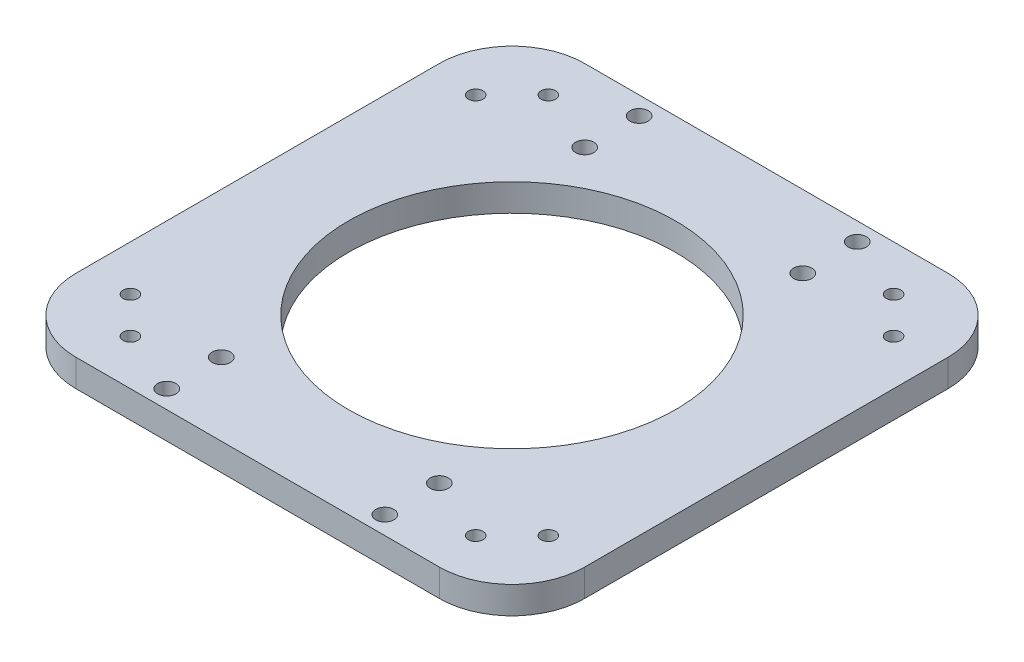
ISO-10303-21;
HEADER;
FILE_DESCRIPTION(('STEP AP214'),'2;1');
FILE_NAME('part.step','',(''),(''),'','','');
FILE_SCHEMA(('AUTOMOTIVE_DESIGN { 1 0 10303 214 1 1 1 1 }'));
ENDSEC;
DATA;
#1=APPLICATION_CONTEXT('core data for automotive mechanical design processes');
#2=APPLICATION_PROTOCOL_DEFINITION('international standard','automotive_design',2000,#1);
#3=PRODUCT_CONTEXT('',#1,'mechanical');
#4=PRODUCT('Part','Part','',(#3));
#5=PRODUCT_RELATED_PRODUCT_CATEGORY('part','',(#4));
#6=PRODUCT_DEFINITION_FORMATION('','',#4);
#7=PRODUCT_DEFINITION_CONTEXT('part definition',#1,'design');
#8=PRODUCT_DEFINITION('design','',#6,#7);
#9=PRODUCT_DEFINITION_SHAPE('','',#8);
#10=(LENGTH_UNIT() NAMED_UNIT(*) SI_UNIT(.MILLI.,.METRE.));
#11=(NAMED_UNIT(*) PLANE_ANGLE_UNIT() SI_UNIT($,.RADIAN.));
#12=(NAMED_UNIT(*) SI_UNIT($,.STERADIAN.) SOLID_ANGLE_UNIT());
#13=UNCERTAINTY_MEASURE_WITH_UNIT(LENGTH_MEASURE(1.E-05),#10,'distance_accuracy_value','');
#14=(GEOMETRIC_REPRESENTATION_CONTEXT(3) GLOBAL_UNCERTAINTY_ASSIGNED_CONTEXT((#13)) GLOBAL_UNIT_ASSIGNED_CONTEXT((#10,
#11,#12)) REPRESENTATION_CONTEXT('',''));
#15=CARTESIAN_POINT('',(0.,0.,0.));
#16=DIRECTION('',(0.,0.,1.));
#17=DIRECTION('',(1.,0.,0.));
#18=AXIS2_PLACEMENT_3D('',#15,#16,#17);
#19=CARTESIAN_POINT('',(88.9,9.525,-88.9));
#20=DIRECTION('',(-1.,0.,0.));
#21=DIRECTION('',(0.,0.,1.));
#22=AXIS2_PLACEMENT_3D('',#19,#20,#21);
#23=PLANE('',#22);
#24=DIRECTION('',(0.,0.,-1.));
#25=VECTOR('',#24,1.);
#26=CARTESIAN_POINT('',(88.9,9.525,-88.9));
#27=LINE('',#26,#25);
#28=CARTESIAN_POINT('',(88.9,9.525,63.4999999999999));
#29=VERTEX_POINT('',#28);
#30=CARTESIAN_POINT('',(88.9,9.525,-63.5));
#31=VERTEX_POINT('',#30);
#32=EDGE_CURVE('E126',#29,#31,#27,.T.);
#33=ORIENTED_EDGE('',*,*,#32,.F.);
#34=DIRECTION('',(0.,-1.,0.));
#35=VECTOR('',#34,1.);
#36=CARTESIAN_POINT('',(88.9,9.525,63.4999999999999));
#37=LINE('',#36,#35);
#38=CARTESIAN_POINT('',(88.9,0.,63.4999999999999));
#39=VERTEX_POINT('',#38);
#40=EDGE_CURVE('E152',#29,#39,#37,.T.);
#41=ORIENTED_EDGE('',*,*,#40,.T.);
#42=DIRECTION('',(0.,0.,-1.));
#43=VECTOR('',#42,1.);
#44=CARTESIAN_POINT('',(88.9,0.,-88.9));
#45=LINE('',#44,#43);
#46=CARTESIAN_POINT('',(88.9,0.,-63.5));
#47=VERTEX_POINT('',#46);
#48=EDGE_CURVE('E158',#39,#47,#45,.T.);
#49=ORIENTED_EDGE('',*,*,#48,.T.);
#50=DIRECTION('',(0.,-1.,0.));
#51=VECTOR('',#50,1.);
#52=CARTESIAN_POINT('',(88.9,9.525,-63.5));
#53=LINE('',#52,#51);
#54=EDGE_CURVE('E150',#47,#31,#53,.F.);
#55=ORIENTED_EDGE('',*,*,#54,.T.);
#56=EDGE_LOOP('',(#33,#41,#49,#55));
#57=FACE_BOUND('',#56,.T.);
#58=ADVANCED_FACE('F34',(#57),#23,.F.);
#59=CARTESIAN_POINT('',(-88.9,9.525,-88.9));
#60=DIRECTION('',(0.,0.,1.));
#61=DIRECTION('',(1.,0.,0.));
#62=AXIS2_PLACEMENT_3D('',#59,#60,#61);
#63=PLANE('',#62);
#64=DIRECTION('',(-1.,0.,0.));
#65=VECTOR('',#64,1.);
#66=CARTESIAN_POINT('',(-88.9,9.525,-88.9));
#67=LINE('',#66,#65);
#68=CARTESIAN_POINT('',(63.5,9.525,-88.9));
#69=VERTEX_POINT('',#68);
#70=CARTESIAN_POINT('',(-63.5,9.525,-88.9));
#71=VERTEX_POINT('',#70);
#72=EDGE_CURVE('E129',#69,#71,#67,.T.);
#73=ORIENTED_EDGE('',*,*,#72,.F.);
#74=DIRECTION('',(0.,-1.,0.));
#75=VECTOR('',#74,1.);
#76=CARTESIAN_POINT('',(63.5,9.525,-88.9));
#77=LINE('',#76,#75);
#78=CARTESIAN_POINT('',(63.5,0.,-88.9));
#79=VERTEX_POINT('',#78);
#80=EDGE_CURVE('E11',#69,#79,#77,.T.);
#81=ORIENTED_EDGE('',*,*,#80,.T.);
#82=DIRECTION('',(-1.,0.,0.));
#83=VECTOR('',#82,1.);
#84=CARTESIAN_POINT('',(-88.9,0.,-88.9));
#85=LINE('',#84,#83);
#86=CARTESIAN_POINT('',(-63.5,0.,-88.9));
#87=VERTEX_POINT('',#86);
#88=EDGE_CURVE('E131',#79,#87,#85,.T.);
#89=ORIENTED_EDGE('',*,*,#88,.T.);
#90=DIRECTION('',(0.,-1.,0.));
#91=VECTOR('',#90,1.);
#92=CARTESIAN_POINT('',(-63.5,9.525,-88.9));
#93=LINE('',#92,#91);
#94=EDGE_CURVE('E42',#87,#71,#93,.F.);
#95=ORIENTED_EDGE('',*,*,#94,.T.);
#96=EDGE_LOOP('',(#73,#81,#89,#95));
#97=FACE_BOUND('',#96,.T.);
#98=ADVANCED_FACE('F379',(#97),#63,.F.);
#99=CARTESIAN_POINT('',(-88.9,9.525,-88.9));
#100=DIRECTION('',(1.,0.,0.));
#101=DIRECTION('',(0.,0.,-1.));
#102=AXIS2_PLACEMENT_3D('',#99,#100,#101);
#103=PLANE('',#102);
#104=DIRECTION('',(0.,0.,1.));
#105=VECTOR('',#104,1.);
#106=CARTESIAN_POINT('',(-88.9,0.,-88.9));
#107=LINE('',#106,#105);
#108=CARTESIAN_POINT('',(-88.9,0.,-63.5));
#109=VERTEX_POINT('',#108);
#110=CARTESIAN_POINT('',(-88.9,0.,63.5));
#111=VERTEX_POINT('',#110);
#112=EDGE_CURVE('E127',#109,#111,#107,.T.);
#113=ORIENTED_EDGE('',*,*,#112,.T.);
#114=DIRECTION('',(0.,-1.,0.));
#115=VECTOR('',#114,1.);
#116=CARTESIAN_POINT('',(-88.9,9.525,63.5));
#117=LINE('',#116,#115);
#118=CARTESIAN_POINT('',(-88.9,9.525,63.5));
#119=VERTEX_POINT('',#118);
#120=EDGE_CURVE('E105',#111,#119,#117,.F.);
#121=ORIENTED_EDGE('',*,*,#120,.T.);
#122=DIRECTION('',(0.,0.,1.));
#123=VECTOR('',#122,1.);
#124=CARTESIAN_POINT('',(-88.9,9.525,-88.9));
#125=LINE('',#124,#123);
#126=CARTESIAN_POINT('',(-88.9,9.525,-63.5));
#127=VERTEX_POINT('',#126);
#128=EDGE_CURVE('E170',#127,#119,#125,.T.);
#129=ORIENTED_EDGE('',*,*,#128,.F.);
#130=DIRECTION('',(0.,-1.,0.));
#131=VECTOR('',#130,1.);
#132=CARTESIAN_POINT('',(-88.9,9.525,-63.5));
#133=LINE('',#132,#131);
#134=EDGE_CURVE('E110',#127,#109,#133,.T.);
#135=ORIENTED_EDGE('',*,*,#134,.T.);
#136=EDGE_LOOP('',(#113,#121,#129,#135));
#137=FACE_BOUND('',#136,.T.);
#138=ADVANCED_FACE('F377',(#137),#103,.F.);
#139=CARTESIAN_POINT('',(-88.9,9.525,88.9));
#140=DIRECTION('',(0.,0.,-1.));
#141=DIRECTION('',(-1.,0.,0.));
#142=AXIS2_PLACEMENT_3D('',#139,#140,#141);
#143=PLANE('',#142);
#144=DIRECTION('',(1.,0.,0.));
#145=VECTOR('',#144,1.);
#146=CARTESIAN_POINT('',(-88.9,9.525,88.9));
#147=LINE('',#146,#145);
#148=CARTESIAN_POINT('',(-63.5,9.525,88.9));
#149=VERTEX_POINT('',#148);
#150=CARTESIAN_POINT('',(63.5,9.525,88.9));
#151=VERTEX_POINT('',#150);
#152=EDGE_CURVE('E120',#149,#151,#147,.T.);
#153=ORIENTED_EDGE('',*,*,#152,.F.);
#154=DIRECTION('',(0.,-1.,0.));
#155=VECTOR('',#154,1.);
#156=CARTESIAN_POINT('',(-63.5,9.525,88.9));
#157=LINE('',#156,#155);
#158=CARTESIAN_POINT('',(-63.5,0.,88.9));
#159=VERTEX_POINT('',#158);
#160=EDGE_CURVE('E104',#149,#159,#157,.T.);
#161=ORIENTED_EDGE('',*,*,#160,.T.);
#162=DIRECTION('',(1.,0.,0.));
#163=VECTOR('',#162,1.);
#164=CARTESIAN_POINT('',(-88.9,0.,88.9));
#165=LINE('',#164,#163);
#166=CARTESIAN_POINT('',(63.5,0.,88.9));
#167=VERTEX_POINT('',#166);
#168=EDGE_CURVE('E117',#159,#167,#165,.T.);
#169=ORIENTED_EDGE('',*,*,#168,.T.);
#170=DIRECTION('',(0.,-1.,0.));
#171=VECTOR('',#170,1.);
#172=CARTESIAN_POINT('',(63.5,9.525,88.9));
#173=LINE('',#172,#171);
#174=EDGE_CURVE('E122',#167,#151,#173,.F.);
#175=ORIENTED_EDGE('',*,*,#174,.T.);
#176=EDGE_LOOP('',(#153,#161,#169,#175));
#177=FACE_BOUND('',#176,.T.);
#178=ADVANCED_FACE('F116',(#177),#143,.F.);
#179=CARTESIAN_POINT('',(0.,9.525,0.));
#180=DIRECTION('',(0.,1.,0.));
#181=DIRECTION('',(0.,0.,1.));
#182=AXIS2_PLACEMENT_3D('',#179,#180,#181);
#183=PLANE('',#182);
#184=CARTESIAN_POINT('',(-73.0249999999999,9.525,-60.325));
#185=DIRECTION('',(0.,-1.,0.));
#186=DIRECTION('',(0.,0.,1.));
#187=AXIS2_PLACEMENT_3D('',#184,#185,#186);
#188=CIRCLE('',#187,2.55270000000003);
#189=CARTESIAN_POINT('',(-73.0249999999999,9.525,-62.8777000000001));
#190=VERTEX_POINT('',#189);
#191=EDGE_CURVE('E306',#190,#190,#188,.T.);
#192=ORIENTED_EDGE('',*,*,#191,.T.);
#193=EDGE_LOOP('',(#192));
#194=FACE_BOUND('',#193,.T.);
#195=CARTESIAN_POINT('',(73.025,9.525,-60.325));
#196=DIRECTION('',(0.,-1.,0.));
#197=DIRECTION('',(0.,0.,-1.));
#198=AXIS2_PLACEMENT_3D('',#195,#196,#197);
#199=CIRCLE('',#198,2.55270000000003);
#200=CARTESIAN_POINT('',(73.025,9.525,-62.8777));
#201=VERTEX_POINT('',#200);
#202=EDGE_CURVE('E312',#201,#201,#199,.T.);
#203=ORIENTED_EDGE('',*,*,#202,.T.);
#204=EDGE_LOOP('',(#203));
#205=FACE_BOUND('',#204,.T.);
#206=CARTESIAN_POINT('',(73.025,9.525,60.325));
#207=DIRECTION('',(0.,-1.,0.));
#208=DIRECTION('',(0.,0.,1.));
#209=AXIS2_PLACEMENT_3D('',#206,#207,#208);
#210=CIRCLE('',#209,2.55270000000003);
#211=CARTESIAN_POINT('',(73.025,9.525,57.7723));
#212=VERTEX_POINT('',#211);
#213=EDGE_CURVE('E300',#212,#212,#210,.T.);
#214=ORIENTED_EDGE('',*,*,#213,.T.);
#215=EDGE_LOOP('',(#214));
#216=FACE_BOUND('',#215,.T.);
#217=CARTESIAN_POINT('',(-73.025,9.525,60.325));
#218=DIRECTION('',(0.,-1.,0.));
#219=DIRECTION('',(0.,0.,-1.));
#220=AXIS2_PLACEMENT_3D('',#217,#218,#219);
#221=CIRCLE('',#220,2.55270000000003);
#222=CARTESIAN_POINT('',(-73.025,9.525,57.7723));
#223=VERTEX_POINT('',#222);
#224=EDGE_CURVE('E283',#223,#223,#221,.T.);
#225=ORIENTED_EDGE('',*,*,#224,.T.);
#226=EDGE_LOOP('',(#225));
#227=FACE_BOUND('',#226,.T.);
#228=CARTESIAN_POINT('',(60.325,9.525,73.025));
#229=DIRECTION('',(0.,1.,0.));
#230=DIRECTION('',(0.,0.,-1.));
#231=AXIS2_PLACEMENT_3D('',#228,#229,#230);
#232=CIRCLE('',#231,2.5527);
#233=CARTESIAN_POINT('',(60.325,9.525,75.5777));
#234=VERTEX_POINT('',#233);
#235=EDGE_CURVE('E231',#234,#234,#232,.T.);
#236=ORIENTED_EDGE('',*,*,#235,.F.);
#237=EDGE_LOOP('',(#236));
#238=FACE_BOUND('',#237,.T.);
#239=CARTESIAN_POINT('',(-60.325,9.525,73.025));
#240=DIRECTION('',(0.,1.,0.));
#241=DIRECTION('',(0.,0.,1.));
#242=AXIS2_PLACEMENT_3D('',#239,#240,#241);
#243=CIRCLE('',#242,2.5527);
#244=CARTESIAN_POINT('',(-60.325,9.525,75.5777));
#245=VERTEX_POINT('',#244);
#246=EDGE_CURVE('E238',#245,#245,#243,.T.);
#247=ORIENTED_EDGE('',*,*,#246,.F.);
#248=EDGE_LOOP('',(#247));
#249=FACE_BOUND('',#248,.T.);
#250=CARTESIAN_POINT('',(-60.325,9.525,-73.025));
#251=DIRECTION('',(0.,1.,0.));
#252=DIRECTION('',(0.,0.,-1.));
#253=AXIS2_PLACEMENT_3D('',#250,#251,#252);
#254=CIRCLE('',#253,2.5527);
#255=CARTESIAN_POINT('',(-60.325,9.525,-70.4723));
#256=VERTEX_POINT('',#255);
#257=EDGE_CURVE('E244',#256,#256,#254,.T.);
#258=ORIENTED_EDGE('',*,*,#257,.F.);
#259=EDGE_LOOP('',(#258));
#260=FACE_BOUND('',#259,.T.);
#261=CARTESIAN_POINT('',(60.325,9.525,-73.025));
#262=DIRECTION('',(0.,1.,0.));
#263=DIRECTION('',(0.,0.,1.));
#264=AXIS2_PLACEMENT_3D('',#261,#262,#263);
#265=CIRCLE('',#264,2.5527);
#266=CARTESIAN_POINT('',(60.325,9.525,-70.4723));
#267=VERTEX_POINT('',#266);
#268=EDGE_CURVE('E225',#267,#267,#265,.T.);
#269=ORIENTED_EDGE('',*,*,#268,.F.);
#270=EDGE_LOOP('',(#269));
#271=FACE_BOUND('',#270,.T.);
#272=CARTESIAN_POINT('',(-38.1,9.525,82.5499999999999));
#273=DIRECTION('',(0.,1.,0.));
#274=DIRECTION('',(0.,0.,1.));
#275=AXIS2_PLACEMENT_3D('',#272,#273,#274);
#276=CIRCLE('',#275,3.175);
#277=CARTESIAN_POINT('',(-38.1,9.525,85.7249999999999));
#278=VERTEX_POINT('',#277);
#279=EDGE_CURVE('E195',#278,#278,#276,.T.);
#280=ORIENTED_EDGE('',*,*,#279,.F.);
#281=EDGE_LOOP('',(#280));
#282=FACE_BOUND('',#281,.T.);
#283=CARTESIAN_POINT('',(-38.1,9.525,-82.5499999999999));
#284=DIRECTION('',(0.,1.,0.));
#285=DIRECTION('',(0.,0.,-1.));
#286=AXIS2_PLACEMENT_3D('',#283,#284,#285);
#287=CIRCLE('',#286,3.175);
#288=CARTESIAN_POINT('',(-38.1,9.525,-85.7249999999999));
#289=VERTEX_POINT('',#288);
#290=EDGE_CURVE('E202',#289,#289,#287,.T.);
#291=ORIENTED_EDGE('',*,*,#290,.F.);
#292=EDGE_LOOP('',(#291));
#293=FACE_BOUND('',#292,.T.);
#294=CARTESIAN_POINT('',(-38.1,9.525,-63.5));
#295=DIRECTION('',(0.,1.,0.));
#296=DIRECTION('',(0.,0.,1.));
#297=AXIS2_PLACEMENT_3D('',#294,#295,#296);
#298=CIRCLE('',#297,3.175);
#299=CARTESIAN_POINT('',(-38.1,9.525,-60.325));
#300=VERTEX_POINT('',#299);
#301=EDGE_CURVE('E183',#300,#300,#298,.T.);
#302=ORIENTED_EDGE('',*,*,#301,.F.);
#303=EDGE_LOOP('',(#302));
#304=FACE_BOUND('',#303,.T.);
#305=CARTESIAN_POINT('',(38.1,9.525,-63.5));
#306=DIRECTION('',(0.,1.,0.));
#307=DIRECTION('',(0.,0.,-1.));
#308=AXIS2_PLACEMENT_3D('',#305,#306,#307);
#309=CIRCLE('',#308,3.175);
#310=CARTESIAN_POINT('',(38.1,9.525,-66.675));
#311=VERTEX_POINT('',#310);
#312=EDGE_CURVE('E190',#311,#311,#309,.T.);
#313=ORIENTED_EDGE('',*,*,#312,.F.);
#314=EDGE_LOOP('',(#313));
#315=FACE_BOUND('',#314,.T.);
#316=CARTESIAN_POINT('',(-38.1,9.525,63.5));
#317=DIRECTION('',(0.,1.,0.));
#318=DIRECTION('',(0.,0.,-1.));
#319=AXIS2_PLACEMENT_3D('',#316,#317,#318);
#320=CIRCLE('',#319,3.175);
#321=CARTESIAN_POINT('',(-38.1,9.525,60.325));
#322=VERTEX_POINT('',#321);
#323=EDGE_CURVE('E220',#322,#322,#320,.T.);
#324=ORIENTED_EDGE('',*,*,#323,.F.);
#325=EDGE_LOOP('',(#324));
#326=FACE_BOUND('',#325,.T.);
#327=CARTESIAN_POINT('',(38.1,9.525,63.5));
#328=DIRECTION('',(0.,1.,0.));
#329=DIRECTION('',(0.,0.,1.));
#330=AXIS2_PLACEMENT_3D('',#327,#328,#329);
#331=CIRCLE('',#330,3.175);
#332=CARTESIAN_POINT('',(38.1,9.525,66.675));
#333=VERTEX_POINT('',#332);
#334=EDGE_CURVE('E214',#333,#333,#331,.T.);
#335=ORIENTED_EDGE('',*,*,#334,.F.);
#336=EDGE_LOOP('',(#335));
#337=FACE_BOUND('',#336,.T.);
#338=CARTESIAN_POINT('',(38.1,9.525,82.5499999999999));
#339=DIRECTION('',(0.,1.,0.));
#340=DIRECTION('',(0.,0.,-1.));
#341=AXIS2_PLACEMENT_3D('',#338,#339,#340);
#342=CIRCLE('',#341,3.175);
#343=CARTESIAN_POINT('',(38.1,9.525,79.3749999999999));
#344=VERTEX_POINT('',#343);
#345=EDGE_CURVE('E207',#344,#344,#342,.T.);
#346=ORIENTED_EDGE('',*,*,#345,.F.);
#347=EDGE_LOOP('',(#346));
#348=FACE_BOUND('',#347,.T.);
#349=CARTESIAN_POINT('',(38.1,9.525,-82.5499999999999));
#350=DIRECTION('',(0.,1.,0.));
#351=DIRECTION('',(0.,0.,1.));
#352=AXIS2_PLACEMENT_3D('',#349,#350,#351);
#353=CIRCLE('',#352,3.175);
#354=CARTESIAN_POINT('',(38.1,9.525,-79.3749999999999));
#355=VERTEX_POINT('',#354);
#356=EDGE_CURVE('E177',#355,#355,#353,.T.);
#357=ORIENTED_EDGE('',*,*,#356,.F.);
#358=EDGE_LOOP('',(#357));
#359=FACE_BOUND('',#358,.T.);
#360=CARTESIAN_POINT('',(0.,9.525,0.));
#361=DIRECTION('',(0.,1.,0.));
#362=DIRECTION('',(0.,0.,1.));
#363=AXIS2_PLACEMENT_3D('',#360,#361,#362);
#364=CIRCLE('',#363,57.15);
#365=CARTESIAN_POINT('',(0.,9.525,57.15));
#366=VERTEX_POINT('',#365);
#367=EDGE_CURVE('E166',#366,#366,#364,.T.);
#368=ORIENTED_EDGE('',*,*,#367,.F.);
#369=EDGE_LOOP('',(#368));
#370=FACE_BOUND('',#369,.T.);
#371=ORIENTED_EDGE('',*,*,#128,.T.);
#372=CARTESIAN_POINT('',(-63.5,9.525,63.5));
#373=DIRECTION('',(0.,1.,0.));
#374=DIRECTION('',(0.,0.,1.));
#375=AXIS2_PLACEMENT_3D('',#372,#373,#374);
#376=CIRCLE('',#375,25.4);
#377=EDGE_CURVE('E148',#119,#149,#376,.T.);
#378=ORIENTED_EDGE('',*,*,#377,.T.);
#379=ORIENTED_EDGE('',*,*,#152,.T.);
#380=CARTESIAN_POINT('',(63.5,9.525,63.4999999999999));
#381=DIRECTION('',(0.,1.,0.));
#382=DIRECTION('',(0.,0.,1.));
#383=AXIS2_PLACEMENT_3D('',#380,#381,#382);
#384=CIRCLE('',#383,25.4);
#385=EDGE_CURVE('E146',#151,#29,#384,.T.);
#386=ORIENTED_EDGE('',*,*,#385,.T.);
#387=ORIENTED_EDGE('',*,*,#32,.T.);
#388=CARTESIAN_POINT('',(63.5,9.525,-63.5));
#389=DIRECTION('',(0.,1.,0.));
#390=DIRECTION('',(0.,0.,1.));
#391=AXIS2_PLACEMENT_3D('',#388,#389,#390);
#392=CIRCLE('',#391,25.4);
#393=EDGE_CURVE('E55',#31,#69,#392,.T.);
#394=ORIENTED_EDGE('',*,*,#393,.T.);
#395=ORIENTED_EDGE('',*,*,#72,.T.);
#396=CARTESIAN_POINT('',(-63.5,9.525,-63.5));
#397=DIRECTION('',(0.,1.,0.));
#398=DIRECTION('',(0.,0.,1.));
#399=AXIS2_PLACEMENT_3D('',#396,#397,#398);
#400=CIRCLE('',#399,25.4);
#401=EDGE_CURVE('E143',#71,#127,#400,.T.);
#402=ORIENTED_EDGE('',*,*,#401,.T.);
#403=EDGE_LOOP('',(#371,#378,#379,#386,#387,#394,#395,#402));
#404=FACE_BOUND('',#403,.T.);
#405=ADVANCED_FACE('F321',(#194,#205,#216,#227,#238,#249,#260,#271,#282,#293,#304,#315,#326,
#337,#348,#359,#370,#404),#183,.T.);
#406=CARTESIAN_POINT('',(0.,0.,0.));
#407=DIRECTION('',(0.,1.,0.));
#408=DIRECTION('',(0.,0.,1.));
#409=AXIS2_PLACEMENT_3D('',#406,#407,#408);
#410=PLANE('',#409);
#411=CARTESIAN_POINT('',(-73.0249999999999,0.,-60.325));
#412=DIRECTION('',(0.,-1.,0.));
#413=DIRECTION('',(0.,0.,1.));
#414=AXIS2_PLACEMENT_3D('',#411,#412,#413);
#415=CIRCLE('',#414,2.55270000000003);
#416=CARTESIAN_POINT('',(-73.0249999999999,0.,-62.8777000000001));
#417=VERTEX_POINT('',#416);
#418=EDGE_CURVE('E303',#417,#417,#415,.T.);
#419=ORIENTED_EDGE('',*,*,#418,.F.);
#420=EDGE_LOOP('',(#419));
#421=FACE_BOUND('',#420,.T.);
#422=CARTESIAN_POINT('',(73.025,0.,-60.325));
#423=DIRECTION('',(0.,-1.,0.));
#424=DIRECTION('',(0.,0.,-1.));
#425=AXIS2_PLACEMENT_3D('',#422,#423,#424);
#426=CIRCLE('',#425,2.55270000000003);
#427=CARTESIAN_POINT('',(73.025,0.,-62.8777));
#428=VERTEX_POINT('',#427);
#429=EDGE_CURVE('E309',#428,#428,#426,.T.);
#430=ORIENTED_EDGE('',*,*,#429,.F.);
#431=EDGE_LOOP('',(#430));
#432=FACE_BOUND('',#431,.T.);
#433=CARTESIAN_POINT('',(73.025,0.,60.325));
#434=DIRECTION('',(0.,-1.,0.));
#435=DIRECTION('',(0.,0.,1.));
#436=AXIS2_PLACEMENT_3D('',#433,#434,#435);
#437=CIRCLE('',#436,2.55270000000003);
#438=CARTESIAN_POINT('',(73.025,0.,57.7723));
#439=VERTEX_POINT('',#438);
#440=EDGE_CURVE('E315',#439,#439,#437,.T.);
#441=ORIENTED_EDGE('',*,*,#440,.F.);
#442=EDGE_LOOP('',(#441));
#443=FACE_BOUND('',#442,.T.);
#444=CARTESIAN_POINT('',(-73.025,0.,60.325));
#445=DIRECTION('',(0.,-1.,0.));
#446=DIRECTION('',(0.,0.,-1.));
#447=AXIS2_PLACEMENT_3D('',#444,#445,#446);
#448=CIRCLE('',#447,2.55270000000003);
#449=CARTESIAN_POINT('',(-73.025,0.,57.7723));
#450=VERTEX_POINT('',#449);
#451=EDGE_CURVE('E297',#450,#450,#448,.T.);
#452=ORIENTED_EDGE('',*,*,#451,.F.);
#453=EDGE_LOOP('',(#452));
#454=FACE_BOUND('',#453,.T.);
#455=CARTESIAN_POINT('',(62.865,0.,38.1));
#456=DIRECTION('',(0.,-1.,0.));
#457=DIRECTION('',(0.,0.,-1.));
#458=AXIS2_PLACEMENT_3D('',#455,#456,#457);
#459=CIRCLE('',#458,3.175);
#460=CARTESIAN_POINT('',(62.865,0.,34.925));
#461=VERTEX_POINT('',#460);
#462=EDGE_CURVE('E267',#461,#461,#459,.T.);
#463=ORIENTED_EDGE('',*,*,#462,.F.);
#464=EDGE_LOOP('',(#463));
#465=FACE_BOUND('',#464,.T.);
#466=CARTESIAN_POINT('',(-82.55,0.,-38.1));
#467=DIRECTION('',(0.,-1.,0.));
#468=DIRECTION('',(0.,0.,1.));
#469=AXIS2_PLACEMENT_3D('',#466,#467,#468);
#470=CIRCLE('',#469,3.175);
#471=CARTESIAN_POINT('',(-82.55,0.,-34.925));
#472=VERTEX_POINT('',#471);
#473=EDGE_CURVE('E274',#472,#472,#470,.T.);
#474=ORIENTED_EDGE('',*,*,#473,.F.);
#475=EDGE_LOOP('',(#474));
#476=FACE_BOUND('',#475,.T.);
#477=CARTESIAN_POINT('',(-63.5,0.,-38.1));
#478=DIRECTION('',(0.,-1.,0.));
#479=DIRECTION('',(0.,0.,-1.));
#480=AXIS2_PLACEMENT_3D('',#477,#478,#479);
#481=CIRCLE('',#480,3.175);
#482=CARTESIAN_POINT('',(-63.5,0.,-41.275));
#483=VERTEX_POINT('',#482);
#484=EDGE_CURVE('E255',#483,#483,#481,.T.);
#485=ORIENTED_EDGE('',*,*,#484,.F.);
#486=EDGE_LOOP('',(#485));
#487=FACE_BOUND('',#486,.T.);
#488=CARTESIAN_POINT('',(-82.55,0.,38.1));
#489=DIRECTION('',(0.,-1.,0.));
#490=DIRECTION('',(0.,0.,-1.));
#491=AXIS2_PLACEMENT_3D('',#488,#489,#490);
#492=CIRCLE('',#491,3.175);
#493=CARTESIAN_POINT('',(-82.55,0.,34.925));
#494=VERTEX_POINT('',#493);
#495=EDGE_CURVE('E262',#494,#494,#492,.T.);
#496=ORIENTED_EDGE('',*,*,#495,.F.);
#497=EDGE_LOOP('',(#496));
#498=FACE_BOUND('',#497,.T.);
#499=CARTESIAN_POINT('',(62.865,0.,-38.1));
#500=DIRECTION('',(0.,-1.,0.));
#501=DIRECTION('',(0.,0.,1.));
#502=AXIS2_PLACEMENT_3D('',#499,#500,#501);
#503=CIRCLE('',#502,3.175);
#504=CARTESIAN_POINT('',(62.865,0.,-34.925));
#505=VERTEX_POINT('',#504);
#506=EDGE_CURVE('E292',#505,#505,#503,.T.);
#507=ORIENTED_EDGE('',*,*,#506,.F.);
#508=EDGE_LOOP('',(#507));
#509=FACE_BOUND('',#508,.T.);
#510=CARTESIAN_POINT('',(81.915,0.,-38.1));
#511=DIRECTION('',(0.,-1.,0.));
#512=DIRECTION('',(0.,0.,-1.));
#513=AXIS2_PLACEMENT_3D('',#510,#511,#512);
#514=CIRCLE('',#513,3.175);
#515=CARTESIAN_POINT('',(81.915,0.,-41.275));
#516=VERTEX_POINT('',#515);
#517=EDGE_CURVE('E286',#516,#516,#514,.T.);
#518=ORIENTED_EDGE('',*,*,#517,.F.);
#519=EDGE_LOOP('',(#518));
#520=FACE_BOUND('',#519,.T.);
#521=CARTESIAN_POINT('',(81.915,0.,38.1));
#522=DIRECTION('',(0.,-1.,0.));
#523=DIRECTION('',(0.,0.,1.));
#524=AXIS2_PLACEMENT_3D('',#521,#522,#523);
#525=CIRCLE('',#524,3.175);
#526=CARTESIAN_POINT('',(81.915,0.,41.275));
#527=VERTEX_POINT('',#526);
#528=EDGE_CURVE('E279',#527,#527,#525,.T.);
#529=ORIENTED_EDGE('',*,*,#528,.F.);
#530=EDGE_LOOP('',(#529));
#531=FACE_BOUND('',#530,.T.);
#532=CARTESIAN_POINT('',(-63.5,0.,38.1));
#533=DIRECTION('',(0.,-1.,0.));
#534=DIRECTION('',(0.,0.,1.));
#535=AXIS2_PLACEMENT_3D('',#532,#533,#534);
#536=CIRCLE('',#535,3.175);
#537=CARTESIAN_POINT('',(-63.5,0.,41.275));
#538=VERTEX_POINT('',#537);
#539=EDGE_CURVE('E249',#538,#538,#536,.T.);
#540=ORIENTED_EDGE('',*,*,#539,.F.);
#541=EDGE_LOOP('',(#540));
#542=FACE_BOUND('',#541,.T.);
#543=CARTESIAN_POINT('',(60.325,0.,73.025));
#544=DIRECTION('',(0.,1.,0.));
#545=DIRECTION('',(0.,0.,-1.));
#546=AXIS2_PLACEMENT_3D('',#543,#544,#545);
#547=CIRCLE('',#546,2.5527);
#548=CARTESIAN_POINT('',(60.325,0.,75.5777));
#549=VERTEX_POINT('',#548);
#550=EDGE_CURVE('E234',#549,#549,#547,.T.);
#551=ORIENTED_EDGE('',*,*,#550,.T.);
#552=EDGE_LOOP('',(#551));
#553=FACE_BOUND('',#552,.T.);
#554=CARTESIAN_POINT('',(-60.325,0.,73.025));
#555=DIRECTION('',(0.,1.,0.));
#556=DIRECTION('',(0.,0.,1.));
#557=AXIS2_PLACEMENT_3D('',#554,#555,#556);
#558=CIRCLE('',#557,2.5527);
#559=CARTESIAN_POINT('',(-60.325,0.,75.5777));
#560=VERTEX_POINT('',#559);
#561=EDGE_CURVE('E241',#560,#560,#558,.T.);
#562=ORIENTED_EDGE('',*,*,#561,.T.);
#563=EDGE_LOOP('',(#562));
#564=FACE_BOUND('',#563,.T.);
#565=CARTESIAN_POINT('',(-60.325,0.,-73.025));
#566=DIRECTION('',(0.,1.,0.));
#567=DIRECTION('',(0.,0.,-1.));
#568=AXIS2_PLACEMENT_3D('',#565,#566,#567);
#569=CIRCLE('',#568,2.5527);
#570=CARTESIAN_POINT('',(-60.325,0.,-70.4723));
#571=VERTEX_POINT('',#570);
#572=EDGE_CURVE('E228',#571,#571,#569,.T.);
#573=ORIENTED_EDGE('',*,*,#572,.T.);
#574=EDGE_LOOP('',(#573));
#575=FACE_BOUND('',#574,.T.);
#576=CARTESIAN_POINT('',(60.325,0.,-73.025));
#577=DIRECTION('',(0.,1.,0.));
#578=DIRECTION('',(0.,0.,1.));
#579=AXIS2_PLACEMENT_3D('',#576,#577,#578);
#580=CIRCLE('',#579,2.5527);
#581=CARTESIAN_POINT('',(60.325,0.,-70.4723));
#582=VERTEX_POINT('',#581);
#583=EDGE_CURVE('E211',#582,#582,#580,.T.);
#584=ORIENTED_EDGE('',*,*,#583,.T.);
#585=EDGE_LOOP('',(#584));
#586=FACE_BOUND('',#585,.T.);
#587=CARTESIAN_POINT('',(0.,0.,0.));
#588=DIRECTION('',(0.,1.,0.));
#589=DIRECTION('',(0.,0.,1.));
#590=AXIS2_PLACEMENT_3D('',#587,#588,#589);
#591=CIRCLE('',#590,57.15);
#592=CARTESIAN_POINT('',(0.,0.,57.15));
#593=VERTEX_POINT('',#592);
#594=EDGE_CURVE('E163',#593,#593,#591,.T.);
#595=ORIENTED_EDGE('',*,*,#594,.T.);
#596=EDGE_LOOP('',(#595));
#597=FACE_BOUND('',#596,.T.);
#598=ORIENTED_EDGE('',*,*,#168,.F.);
#599=CARTESIAN_POINT('',(-63.5,0.,63.5));
#600=DIRECTION('',(0.,1.,0.));
#601=DIRECTION('',(0.,0.,1.));
#602=AXIS2_PLACEMENT_3D('',#599,#600,#601);
#603=CIRCLE('',#602,25.4);
#604=EDGE_CURVE('E100',#159,#111,#603,.F.);
#605=ORIENTED_EDGE('',*,*,#604,.T.);
#606=ORIENTED_EDGE('',*,*,#112,.F.);
#607=CARTESIAN_POINT('',(-63.5,0.,-63.5));
#608=DIRECTION('',(0.,1.,0.));
#609=DIRECTION('',(0.,0.,1.));
#610=AXIS2_PLACEMENT_3D('',#607,#608,#609);
#611=CIRCLE('',#610,25.4);
#612=EDGE_CURVE('E121',#109,#87,#611,.F.);
#613=ORIENTED_EDGE('',*,*,#612,.T.);
#614=ORIENTED_EDGE('',*,*,#88,.F.);
#615=CARTESIAN_POINT('',(63.5,0.,-63.5));
#616=DIRECTION('',(0.,1.,0.));
#617=DIRECTION('',(0.,0.,1.));
#618=AXIS2_PLACEMENT_3D('',#615,#616,#617);
#619=CIRCLE('',#618,25.4);
#620=EDGE_CURVE('E137',#79,#47,#619,.F.);
#621=ORIENTED_EDGE('',*,*,#620,.T.);
#622=ORIENTED_EDGE('',*,*,#48,.F.);
#623=CARTESIAN_POINT('',(63.5,0.,63.4999999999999));
#624=DIRECTION('',(0.,1.,0.));
#625=DIRECTION('',(0.,0.,1.));
#626=AXIS2_PLACEMENT_3D('',#623,#624,#625);
#627=CIRCLE('',#626,25.4);
#628=EDGE_CURVE('E111',#39,#167,#627,.F.);
#629=ORIENTED_EDGE('',*,*,#628,.T.);
#630=EDGE_LOOP('',(#598,#605,#606,#613,#614,#621,#622,#629));
#631=FACE_BOUND('',#630,.T.);
#632=ADVANCED_FACE('F124',(#421,#432,#443,#454,#465,#476,#487,#498,#509,#520,#531,#542,#553,
#564,#575,#586,#597,#631),#410,.F.);
#633=CARTESIAN_POINT('',(0.,0.,0.));
#634=DIRECTION('',(0.,1.,0.));
#635=DIRECTION('',(0.,0.,1.));
#636=AXIS2_PLACEMENT_3D('',#633,#634,#635);
#637=CYLINDRICAL_SURFACE('',#636,57.15);
#638=CARTESIAN_POINT('',(0.,0.,57.15));
#639=CARTESIAN_POINT('',(0.,0.0992187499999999,57.15));
#640=CARTESIAN_POINT('',(0.,0.1984375,57.15));
#641=CARTESIAN_POINT('',(0.,0.396875,57.15));
#642=CARTESIAN_POINT('',(0.,0.49609375,57.15));
#643=CARTESIAN_POINT('',(0.,0.69453125,57.15));
#644=CARTESIAN_POINT('',(0.,0.79375,57.15));
#645=CARTESIAN_POINT('',(0.,0.9921875,57.15));
#646=CARTESIAN_POINT('',(0.,1.09140625,57.15));
#647=CARTESIAN_POINT('',(0.,1.28984375,57.15));
#648=CARTESIAN_POINT('',(0.,1.3890625,57.15));
#649=CARTESIAN_POINT('',(0.,1.5875,57.15));
#650=CARTESIAN_POINT('',(0.,1.68671875,57.15));
#651=CARTESIAN_POINT('',(0.,1.88515625,57.15));
#652=CARTESIAN_POINT('',(0.,1.984375,57.15));
#653=CARTESIAN_POINT('',(0.,2.1828125,57.15));
#654=CARTESIAN_POINT('',(0.,2.28203125,57.15));
#655=CARTESIAN_POINT('',(0.,2.48046875,57.15));
#656=CARTESIAN_POINT('',(0.,2.5796875,57.15));
#657=CARTESIAN_POINT('',(0.,2.778125,57.15));
#658=CARTESIAN_POINT('',(0.,2.87734375,57.15));
#659=CARTESIAN_POINT('',(0.,3.07578125,57.15));
#660=CARTESIAN_POINT('',(0.,3.175,57.15));
#661=CARTESIAN_POINT('',(0.,3.3734375,57.15));
#662=CARTESIAN_POINT('',(0.,3.47265625,57.15));
#663=CARTESIAN_POINT('',(0.,3.67109375,57.15));
#664=CARTESIAN_POINT('',(0.,3.7703125,57.15));
#665=CARTESIAN_POINT('',(0.,3.96875,57.15));
#666=CARTESIAN_POINT('',(0.,4.06796875,57.15));
#667=CARTESIAN_POINT('',(0.,4.26640625,57.15));
#668=CARTESIAN_POINT('',(0.,4.365625,57.15));
#669=CARTESIAN_POINT('',(0.,4.5640625,57.15));
#670=CARTESIAN_POINT('',(0.,4.66328125,57.15));
#671=CARTESIAN_POINT('',(0.,4.86171875,57.15));
#672=CARTESIAN_POINT('',(0.,4.9609375,57.15));
#673=CARTESIAN_POINT('',(0.,5.159375,57.15));
#674=CARTESIAN_POINT('',(0.,5.25859375,57.15));
#675=CARTESIAN_POINT('',(0.,5.45703125,57.15));
#676=CARTESIAN_POINT('',(0.,5.55625,57.15));
#677=CARTESIAN_POINT('',(0.,5.7546875,57.15));
#678=CARTESIAN_POINT('',(0.,5.85390625,57.15));
#679=CARTESIAN_POINT('',(0.,6.05234375,57.15));
#680=CARTESIAN_POINT('',(0.,6.1515625,57.15));
#681=CARTESIAN_POINT('',(0.,6.35,57.15));
#682=CARTESIAN_POINT('',(0.,6.44921875,57.15));
#683=CARTESIAN_POINT('',(0.,6.64765625,57.15));
#684=CARTESIAN_POINT('',(0.,6.746875,57.15));
#685=CARTESIAN_POINT('',(0.,6.9453125,57.15));
#686=CARTESIAN_POINT('',(0.,7.04453125,57.15));
#687=CARTESIAN_POINT('',(0.,7.24296875,57.15));
#688=CARTESIAN_POINT('',(0.,7.3421875,57.15));
#689=CARTESIAN_POINT('',(0.,7.540625,57.15));
#690=CARTESIAN_POINT('',(0.,7.63984375,57.15));
#691=CARTESIAN_POINT('',(0.,7.83828125,57.15));
#692=CARTESIAN_POINT('',(0.,7.9375,57.15));
#693=CARTESIAN_POINT('',(0.,8.1359375,57.15));
#694=CARTESIAN_POINT('',(0.,8.23515625,57.15));
#695=CARTESIAN_POINT('',(0.,8.43359375,57.15));
#696=CARTESIAN_POINT('',(0.,8.5328125,57.15));
#697=CARTESIAN_POINT('',(0.,8.73125,57.15));
#698=CARTESIAN_POINT('',(0.,8.83046875,57.15));
#699=CARTESIAN_POINT('',(0.,9.02890625,57.15));
#700=CARTESIAN_POINT('',(0.,9.128125,57.15));
#701=CARTESIAN_POINT('',(0.,9.3265625,57.15));
#702=CARTESIAN_POINT('',(0.,9.42578125,57.15));
#703=CARTESIAN_POINT('',(0.,9.525,57.15));
#704=B_SPLINE_CURVE_WITH_KNOTS('',3,(#638,#639,#640,#641,#642,#643,#644,#645,#646,#647,#648,
#649,#650,#651,#652,#653,#654,#655,#656,#657,#658,#659,#660,#661,#662,#663,#664,#665,#666,#667,
#668,#669,#670,#671,#672,#673,#674,#675,#676,#677,#678,#679,#680,#681,#682,#683,#684,#685,#686,
#687,#688,#689,#690,#691,#692,#693,#694,#695,#696,#697,#698,#699,#700,#701,#702,#703),
.UNSPECIFIED.,.F.,.F.,(4,2,2,2,2,2,2,2,2,2,2,2,2,2,2,2,2,2,2,2,2,2,2,2,2,2,2,2,2,2,2,2,4),(0.,
0.29765625,0.5953125,0.89296875,1.190625,1.48828125,1.7859375,2.08359375,2.38125,2.67890625,
2.9765625,3.27421875,3.571875,3.86953125,4.1671875,4.46484375,4.7625,5.06015625,5.3578125,
5.65546875,5.953125,6.25078125,6.5484375,6.84609375,7.14375,7.44140625,7.7390625,8.03671875,
8.334375,8.63203125,8.9296875,9.22734375,9.525),.UNSPECIFIED.);
#705=EDGE_CURVE('BSEAM334',#593,#366,#704,.T.);
#706=ORIENTED_EDGE('',*,*,#594,.F.);
#707=ORIENTED_EDGE('',*,*,#367,.T.);
#708=ORIENTED_EDGE('',*,*,#705,.T.);
#709=ORIENTED_EDGE('',*,*,#705,.F.);
#710=EDGE_LOOP('',(#706,#708,#707,#709));
#711=FACE_BOUND('',#710,.T.);
#712=ADVANCED_FACE('F334',(#711),#637,.F.);
#713=CARTESIAN_POINT('',(-63.5,9.525,63.5));
#714=DIRECTION('',(0.,-1.,0.));
#715=DIRECTION('',(0.,0.,-1.));
#716=AXIS2_PLACEMENT_3D('',#713,#714,#715);
#717=CYLINDRICAL_SURFACE('',#716,25.4);
#718=ORIENTED_EDGE('',*,*,#377,.F.);
#719=ORIENTED_EDGE('',*,*,#120,.F.);
#720=ORIENTED_EDGE('',*,*,#604,.F.);
#721=ORIENTED_EDGE('',*,*,#160,.F.);
#722=EDGE_LOOP('',(#718,#719,#720,#721));
#723=FACE_BOUND('',#722,.T.);
#724=ADVANCED_FACE('F103',(#723),#717,.T.);
#725=CARTESIAN_POINT('',(63.5,9.525,63.4999999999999));
#726=DIRECTION('',(0.,-1.,0.));
#727=DIRECTION('',(0.,0.,-1.));
#728=AXIS2_PLACEMENT_3D('',#725,#726,#727);
#729=CYLINDRICAL_SURFACE('',#728,25.4);
#730=ORIENTED_EDGE('',*,*,#385,.F.);
#731=ORIENTED_EDGE('',*,*,#174,.F.);
#732=ORIENTED_EDGE('',*,*,#628,.F.);
#733=ORIENTED_EDGE('',*,*,#40,.F.);
#734=EDGE_LOOP('',(#730,#731,#732,#733));
#735=FACE_BOUND('',#734,.T.);
#736=ADVANCED_FACE('F383',(#735),#729,.T.);
#737=CARTESIAN_POINT('',(63.5,9.525,-63.5));
#738=DIRECTION('',(0.,-1.,0.));
#739=DIRECTION('',(0.,0.,-1.));
#740=AXIS2_PLACEMENT_3D('',#737,#738,#739);
#741=CYLINDRICAL_SURFACE('',#740,25.4);
#742=ORIENTED_EDGE('',*,*,#393,.F.);
#743=ORIENTED_EDGE('',*,*,#54,.F.);
#744=ORIENTED_EDGE('',*,*,#620,.F.);
#745=ORIENTED_EDGE('',*,*,#80,.F.);
#746=EDGE_LOOP('',(#742,#743,#744,#745));
#747=FACE_BOUND('',#746,.T.);
#748=ADVANCED_FACE('F382',(#747),#741,.T.);
#749=CARTESIAN_POINT('',(-63.5,9.525,-63.5));
#750=DIRECTION('',(0.,-1.,0.));
#751=DIRECTION('',(0.,0.,-1.));
#752=AXIS2_PLACEMENT_3D('',#749,#750,#751);
#753=CYLINDRICAL_SURFACE('',#752,25.4);
#754=ORIENTED_EDGE('',*,*,#401,.F.);
#755=ORIENTED_EDGE('',*,*,#94,.F.);
#756=ORIENTED_EDGE('',*,*,#612,.F.);
#757=ORIENTED_EDGE('',*,*,#134,.F.);
#758=EDGE_LOOP('',(#754,#755,#756,#757));
#759=FACE_BOUND('',#758,.T.);
#760=ADVANCED_FACE('F36',(#759),#753,.T.);
#761=CARTESIAN_POINT('',(38.1,3.175,-82.5499999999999));
#762=DIRECTION('',(0.,1.,0.));
#763=DIRECTION('',(0.,0.,1.));
#764=AXIS2_PLACEMENT_3D('',#761,#762,#763);
#765=CYLINDRICAL_SURFACE('',#764,3.175);
#766=CARTESIAN_POINT('',(38.1,3.175,-82.5499999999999));
#767=DIRECTION('',(0.,1.,0.));
#768=DIRECTION('',(0.,0.,1.));
#769=AXIS2_PLACEMENT_3D('',#766,#767,#768);
#770=CIRCLE('',#769,3.175);
#771=CARTESIAN_POINT('',(38.1,3.175,-79.3749999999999));
#772=VERTEX_POINT('',#771);
#773=EDGE_CURVE('E175',#772,#772,#770,.T.);
#774=ORIENTED_EDGE('',*,*,#773,.F.);
#775=EDGE_LOOP('',(#774));
#776=FACE_BOUND('',#775,.T.);
#777=ORIENTED_EDGE('',*,*,#356,.T.);
#778=EDGE_LOOP('',(#777));
#779=FACE_BOUND('',#778,.T.);
#780=ADVANCED_FACE('F402',(#776,#779),#765,.F.);
#781=CARTESIAN_POINT('',(38.1,3.175,-82.5499999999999));
#782=DIRECTION('',(0.,1.,0.));
#783=DIRECTION('',(0.,0.,1.));
#784=AXIS2_PLACEMENT_3D('',#781,#782,#783);
#785=PLANE('',#784);
#786=ORIENTED_EDGE('',*,*,#773,.T.);
#787=EDGE_LOOP('',(#786));
#788=FACE_BOUND('',#787,.T.);
#789=ADVANCED_FACE('F405',(#788),#785,.T.);
#790=CARTESIAN_POINT('',(38.1,3.175,82.5499999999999));
#791=DIRECTION('',(0.,1.,0.));
#792=DIRECTION('',(0.,0.,1.));
#793=AXIS2_PLACEMENT_3D('',#790,#791,#792);
#794=CYLINDRICAL_SURFACE('',#793,3.175);
#795=CARTESIAN_POINT('',(38.1,3.175,82.5499999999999));
#796=DIRECTION('',(0.,1.,0.));
#797=DIRECTION('',(0.,0.,-1.));
#798=AXIS2_PLACEMENT_3D('',#795,#796,#797);
#799=CIRCLE('',#798,3.175);
#800=CARTESIAN_POINT('',(38.1,3.175,79.3749999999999));
#801=VERTEX_POINT('',#800);
#802=EDGE_CURVE('E210',#801,#801,#799,.T.);
#803=ORIENTED_EDGE('',*,*,#802,.F.);
#804=EDGE_LOOP('',(#803));
#805=FACE_BOUND('',#804,.T.);
#806=ORIENTED_EDGE('',*,*,#345,.T.);
#807=EDGE_LOOP('',(#806));
#808=FACE_BOUND('',#807,.T.);
#809=ADVANCED_FACE('F409',(#805,#808),#794,.F.);
#810=CARTESIAN_POINT('',(38.1,3.175,82.5499999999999));
#811=DIRECTION('',(0.,-1.,0.));
#812=DIRECTION('',(0.,0.,-1.));
#813=AXIS2_PLACEMENT_3D('',#810,#811,#812);
#814=PLANE('',#813);
#815=ORIENTED_EDGE('',*,*,#802,.T.);
#816=EDGE_LOOP('',(#815));
#817=FACE_BOUND('',#816,.T.);
#818=ADVANCED_FACE('F447',(#817),#814,.F.);
#819=CARTESIAN_POINT('',(38.1,3.175,63.5));
#820=DIRECTION('',(0.,1.,0.));
#821=DIRECTION('',(0.,0.,1.));
#822=AXIS2_PLACEMENT_3D('',#819,#820,#821);
#823=CYLINDRICAL_SURFACE('',#822,3.175);
#824=CARTESIAN_POINT('',(38.1,3.175,63.5));
#825=DIRECTION('',(0.,1.,0.));
#826=DIRECTION('',(0.,0.,1.));
#827=AXIS2_PLACEMENT_3D('',#824,#825,#826);
#828=CIRCLE('',#827,3.175);
#829=CARTESIAN_POINT('',(38.1,3.175,66.675));
#830=VERTEX_POINT('',#829);
#831=EDGE_CURVE('E217',#830,#830,#828,.T.);
#832=ORIENTED_EDGE('',*,*,#831,.F.);
#833=EDGE_LOOP('',(#832));
#834=FACE_BOUND('',#833,.T.);
#835=ORIENTED_EDGE('',*,*,#334,.T.);
#836=EDGE_LOOP('',(#835));
#837=FACE_BOUND('',#836,.T.);
#838=ADVANCED_FACE('F451',(#834,#837),#823,.F.);
#839=CARTESIAN_POINT('',(38.1,3.175,63.5));
#840=DIRECTION('',(0.,1.,0.));
#841=DIRECTION('',(0.,0.,1.));
#842=AXIS2_PLACEMENT_3D('',#839,#840,#841);
#843=PLANE('',#842);
#844=ORIENTED_EDGE('',*,*,#831,.T.);
#845=EDGE_LOOP('',(#844));
#846=FACE_BOUND('',#845,.T.);
#847=ADVANCED_FACE('F455',(#846),#843,.T.);
#848=CARTESIAN_POINT('',(-38.1,3.175,63.5));
#849=DIRECTION('',(0.,1.,0.));
#850=DIRECTION('',(0.,0.,1.));
#851=AXIS2_PLACEMENT_3D('',#848,#849,#850);
#852=CYLINDRICAL_SURFACE('',#851,3.175);
#853=CARTESIAN_POINT('',(-38.1,3.175,63.5));
#854=DIRECTION('',(0.,1.,0.));
#855=DIRECTION('',(0.,0.,-1.));
#856=AXIS2_PLACEMENT_3D('',#853,#854,#855);
#857=CIRCLE('',#856,3.175);
#858=CARTESIAN_POINT('',(-38.1,3.175,60.325));
#859=VERTEX_POINT('',#858);
#860=EDGE_CURVE('E199',#859,#859,#857,.T.);
#861=ORIENTED_EDGE('',*,*,#860,.F.);
#862=EDGE_LOOP('',(#861));
#863=FACE_BOUND('',#862,.T.);
#864=ORIENTED_EDGE('',*,*,#323,.T.);
#865=EDGE_LOOP('',(#864));
#866=FACE_BOUND('',#865,.T.);
#867=ADVANCED_FACE('F459',(#863,#866),#852,.F.);
#868=CARTESIAN_POINT('',(-38.1,3.175,63.5));
#869=DIRECTION('',(0.,-1.,0.));
#870=DIRECTION('',(0.,0.,-1.));
#871=AXIS2_PLACEMENT_3D('',#868,#869,#870);
#872=PLANE('',#871);
#873=ORIENTED_EDGE('',*,*,#860,.T.);
#874=EDGE_LOOP('',(#873));
#875=FACE_BOUND('',#874,.T.);
#876=ADVANCED_FACE('F424',(#875),#872,.F.);
#877=CARTESIAN_POINT('',(38.1,3.175,-63.5));
#878=DIRECTION('',(0.,1.,0.));
#879=DIRECTION('',(0.,0.,1.));
#880=AXIS2_PLACEMENT_3D('',#877,#878,#879);
#881=CYLINDRICAL_SURFACE('',#880,3.175);
#882=CARTESIAN_POINT('',(38.1,3.175,-63.5));
#883=DIRECTION('',(0.,1.,0.));
#884=DIRECTION('',(0.,0.,-1.));
#885=AXIS2_PLACEMENT_3D('',#882,#883,#884);
#886=CIRCLE('',#885,3.175);
#887=CARTESIAN_POINT('',(38.1,3.175,-66.675));
#888=VERTEX_POINT('',#887);
#889=EDGE_CURVE('E180',#888,#888,#886,.T.);
#890=ORIENTED_EDGE('',*,*,#889,.F.);
#891=EDGE_LOOP('',(#890));
#892=FACE_BOUND('',#891,.T.);
#893=ORIENTED_EDGE('',*,*,#312,.T.);
#894=EDGE_LOOP('',(#893));
#895=FACE_BOUND('',#894,.T.);
#896=ADVANCED_FACE('F421',(#892,#895),#881,.F.);
#897=CARTESIAN_POINT('',(38.1,3.175,-63.5));
#898=DIRECTION('',(0.,-1.,0.));
#899=DIRECTION('',(0.,0.,-1.));
#900=AXIS2_PLACEMENT_3D('',#897,#898,#899);
#901=PLANE('',#900);
#902=ORIENTED_EDGE('',*,*,#889,.T.);
#903=EDGE_LOOP('',(#902));
#904=FACE_BOUND('',#903,.T.);
#905=ADVANCED_FACE('F415',(#904),#901,.F.);
#906=CARTESIAN_POINT('',(-38.1,3.175,-63.5));
#907=DIRECTION('',(0.,1.,0.));
#908=DIRECTION('',(0.,0.,1.));
#909=AXIS2_PLACEMENT_3D('',#906,#907,#908);
#910=CYLINDRICAL_SURFACE('',#909,3.175);
#911=CARTESIAN_POINT('',(-38.1,3.175,-63.5));
#912=DIRECTION('',(0.,1.,0.));
#913=DIRECTION('',(0.,0.,1.));
#914=AXIS2_PLACEMENT_3D('',#911,#912,#913);
#915=CIRCLE('',#914,3.175);
#916=CARTESIAN_POINT('',(-38.1,3.175,-60.325));
#917=VERTEX_POINT('',#916);
#918=EDGE_CURVE('E186',#917,#917,#915,.T.);
#919=ORIENTED_EDGE('',*,*,#918,.F.);
#920=EDGE_LOOP('',(#919));
#921=FACE_BOUND('',#920,.T.);
#922=ORIENTED_EDGE('',*,*,#301,.T.);
#923=EDGE_LOOP('',(#922));
#924=FACE_BOUND('',#923,.T.);
#925=ADVANCED_FACE('F411',(#921,#924),#910,.F.);
#926=CARTESIAN_POINT('',(-38.1,3.175,-63.5));
#927=DIRECTION('',(0.,1.,0.));
#928=DIRECTION('',(0.,0.,1.));
#929=AXIS2_PLACEMENT_3D('',#926,#927,#928);
#930=PLANE('',#929);
#931=ORIENTED_EDGE('',*,*,#918,.T.);
#932=EDGE_LOOP('',(#931));
#933=FACE_BOUND('',#932,.T.);
#934=ADVANCED_FACE('F414',(#933),#930,.T.);
#935=CARTESIAN_POINT('',(-38.1,3.175,-82.5499999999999));
#936=DIRECTION('',(0.,1.,0.));
#937=DIRECTION('',(0.,0.,1.));
#938=AXIS2_PLACEMENT_3D('',#935,#936,#937);
#939=CYLINDRICAL_SURFACE('',#938,3.175);
#940=CARTESIAN_POINT('',(-38.1,3.175,-82.5499999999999));
#941=DIRECTION('',(0.,1.,0.));
#942=DIRECTION('',(0.,0.,-1.));
#943=AXIS2_PLACEMENT_3D('',#940,#941,#942);
#944=CIRCLE('',#943,3.175);
#945=CARTESIAN_POINT('',(-38.1,3.175,-85.7249999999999));
#946=VERTEX_POINT('',#945);
#947=EDGE_CURVE('E187',#946,#946,#944,.T.);
#948=ORIENTED_EDGE('',*,*,#947,.F.);
#949=EDGE_LOOP('',(#948));
#950=FACE_BOUND('',#949,.T.);
#951=ORIENTED_EDGE('',*,*,#290,.T.);
#952=EDGE_LOOP('',(#951));
#953=FACE_BOUND('',#952,.T.);
#954=ADVANCED_FACE('F419',(#950,#953),#939,.F.);
#955=CARTESIAN_POINT('',(-38.1,3.175,-82.5499999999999));
#956=DIRECTION('',(0.,-1.,0.));
#957=DIRECTION('',(0.,0.,-1.));
#958=AXIS2_PLACEMENT_3D('',#955,#956,#957);
#959=PLANE('',#958);
#960=ORIENTED_EDGE('',*,*,#947,.T.);
#961=EDGE_LOOP('',(#960));
#962=FACE_BOUND('',#961,.T.);
#963=ADVANCED_FACE('F433',(#962),#959,.F.);
#964=CARTESIAN_POINT('',(-38.1,3.175,82.5499999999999));
#965=DIRECTION('',(0.,1.,0.));
#966=DIRECTION('',(0.,0.,1.));
#967=AXIS2_PLACEMENT_3D('',#964,#965,#966);
#968=CYLINDRICAL_SURFACE('',#967,3.175);
#969=CARTESIAN_POINT('',(-38.1,3.175,82.5499999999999));
#970=DIRECTION('',(0.,1.,0.));
#971=DIRECTION('',(0.,0.,1.));
#972=AXIS2_PLACEMENT_3D('',#969,#970,#971);
#973=CIRCLE('',#972,3.175);
#974=CARTESIAN_POINT('',(-38.1,3.175,85.7249999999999));
#975=VERTEX_POINT('',#974);
#976=EDGE_CURVE('E198',#975,#975,#973,.T.);
#977=ORIENTED_EDGE('',*,*,#976,.F.);
#978=EDGE_LOOP('',(#977));
#979=FACE_BOUND('',#978,.T.);
#980=ORIENTED_EDGE('',*,*,#279,.T.);
#981=EDGE_LOOP('',(#980));
#982=FACE_BOUND('',#981,.T.);
#983=ADVANCED_FACE('F429',(#979,#982),#968,.F.);
#984=CARTESIAN_POINT('',(-38.1,3.175,82.5499999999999));
#985=DIRECTION('',(0.,1.,0.));
#986=DIRECTION('',(0.,0.,1.));
#987=AXIS2_PLACEMENT_3D('',#984,#985,#986);
#988=PLANE('',#987);
#989=ORIENTED_EDGE('',*,*,#976,.T.);
#990=EDGE_LOOP('',(#989));
#991=FACE_BOUND('',#990,.T.);
#992=ADVANCED_FACE('F432',(#991),#988,.T.);
#993=CARTESIAN_POINT('',(60.325,0.,-73.025));
#994=DIRECTION('',(0.,1.,0.));
#995=DIRECTION('',(0.,0.,1.));
#996=AXIS2_PLACEMENT_3D('',#993,#994,#995);
#997=CYLINDRICAL_SURFACE('',#996,2.5527);
#998=CARTESIAN_POINT('',(60.325,0.,-70.4723));
#999=CARTESIAN_POINT('',(60.325,0.0992187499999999,-70.4723));
#1000=CARTESIAN_POINT('',(60.325,0.1984375,-70.4723));
#1001=CARTESIAN_POINT('',(60.325,0.396875,-70.4723));
#1002=CARTESIAN_POINT('',(60.325,0.49609375,-70.4723));
#1003=CARTESIAN_POINT('',(60.325,0.69453125,-70.4723));
#1004=CARTESIAN_POINT('',(60.325,0.79375,-70.4723));
#1005=CARTESIAN_POINT('',(60.325,0.9921875,-70.4723));
#1006=CARTESIAN_POINT('',(60.325,1.09140625,-70.4723));
#1007=CARTESIAN_POINT('',(60.325,1.28984375,-70.4723));
#1008=CARTESIAN_POINT('',(60.325,1.3890625,-70.4723));
#1009=CARTESIAN_POINT('',(60.325,1.5875,-70.4723));
#1010=CARTESIAN_POINT('',(60.325,1.68671875,-70.4723));
#1011=CARTESIAN_POINT('',(60.325,1.88515625,-70.4723));
#1012=CARTESIAN_POINT('',(60.325,1.984375,-70.4723));
#1013=CARTESIAN_POINT('',(60.325,2.1828125,-70.4723));
#1014=CARTESIAN_POINT('',(60.325,2.28203125,-70.4723));
#1015=CARTESIAN_POINT('',(60.325,2.48046875,-70.4723));
#1016=CARTESIAN_POINT('',(60.325,2.5796875,-70.4723));
#1017=CARTESIAN_POINT('',(60.325,2.778125,-70.4723));
#1018=CARTESIAN_POINT('',(60.325,2.87734375,-70.4723));
#1019=CARTESIAN_POINT('',(60.325,3.07578125,-70.4723));
#1020=CARTESIAN_POINT('',(60.325,3.175,-70.4723));
#1021=CARTESIAN_POINT('',(60.325,3.3734375,-70.4723));
#1022=CARTESIAN_POINT('',(60.325,3.47265625,-70.4723));
#1023=CARTESIAN_POINT('',(60.325,3.67109375,-70.4723));
#1024=CARTESIAN_POINT('',(60.325,3.7703125,-70.4723));
#1025=CARTESIAN_POINT('',(60.325,3.96875,-70.4723));
#1026=CARTESIAN_POINT('',(60.325,4.06796875,-70.4723));
#1027=CARTESIAN_POINT('',(60.325,4.26640625,-70.4723));
#1028=CARTESIAN_POINT('',(60.325,4.365625,-70.4723));
#1029=CARTESIAN_POINT('',(60.325,4.5640625,-70.4723));
#1030=CARTESIAN_POINT('',(60.325,4.66328125,-70.4723));
#1031=CARTESIAN_POINT('',(60.325,4.86171875,-70.4723));
#1032=CARTESIAN_POINT('',(60.325,4.9609375,-70.4723));
#1033=CARTESIAN_POINT('',(60.325,5.159375,-70.4723));
#1034=CARTESIAN_POINT('',(60.325,5.25859375,-70.4723));
#1035=CARTESIAN_POINT('',(60.325,5.45703125,-70.4723));
#1036=CARTESIAN_POINT('',(60.325,5.55625,-70.4723));
#1037=CARTESIAN_POINT('',(60.325,5.7546875,-70.4723));
#1038=CARTESIAN_POINT('',(60.325,5.85390625,-70.4723));
#1039=CARTESIAN_POINT('',(60.325,6.05234375,-70.4723));
#1040=CARTESIAN_POINT('',(60.325,6.1515625,-70.4723));
#1041=CARTESIAN_POINT('',(60.325,6.35,-70.4723));
#1042=CARTESIAN_POINT('',(60.325,6.44921875,-70.4723));
#1043=CARTESIAN_POINT('',(60.325,6.64765625,-70.4723));
#1044=CARTESIAN_POINT('',(60.325,6.746875,-70.4723));
#1045=CARTESIAN_POINT('',(60.325,6.9453125,-70.4723));
#1046=CARTESIAN_POINT('',(60.325,7.04453125,-70.4723));
#1047=CARTESIAN_POINT('',(60.325,7.24296875,-70.4723));
#1048=CARTESIAN_POINT('',(60.325,7.3421875,-70.4723));
#1049=CARTESIAN_POINT('',(60.325,7.540625,-70.4723));
#1050=CARTESIAN_POINT('',(60.325,7.63984375,-70.4723));
#1051=CARTESIAN_POINT('',(60.325,7.83828125,-70.4723));
#1052=CARTESIAN_POINT('',(60.325,7.9375,-70.4723));
#1053=CARTESIAN_POINT('',(60.325,8.1359375,-70.4723));
#1054=CARTESIAN_POINT('',(60.325,8.23515625,-70.4723));
#1055=CARTESIAN_POINT('',(60.325,8.43359375,-70.4723));
#1056=CARTESIAN_POINT('',(60.325,8.5328125,-70.4723));
#1057=CARTESIAN_POINT('',(60.325,8.73125,-70.4723));
#1058=CARTESIAN_POINT('',(60.325,8.83046875,-70.4723));
#1059=CARTESIAN_POINT('',(60.325,9.02890625,-70.4723));
#1060=CARTESIAN_POINT('',(60.325,9.128125,-70.4723));
#1061=CARTESIAN_POINT('',(60.325,9.3265625,-70.4723));
#1062=CARTESIAN_POINT('',(60.325,9.42578125,-70.4723));
#1063=CARTESIAN_POINT('',(60.325,9.525,-70.4723));
#1064=B_SPLINE_CURVE_WITH_KNOTS('',3,(#998,#999,#1000,#1001,#1002,#1003,#1004,#1005,#1006,#1007,
#1008,#1009,#1010,#1011,#1012,#1013,#1014,#1015,#1016,#1017,#1018,#1019,#1020,#1021,#1022,#1023,
#1024,#1025,#1026,#1027,#1028,#1029,#1030,#1031,#1032,#1033,#1034,#1035,#1036,#1037,#1038,#1039,
#1040,#1041,#1042,#1043,#1044,#1045,#1046,#1047,#1048,#1049,#1050,#1051,#1052,#1053,#1054,#1055,
#1056,#1057,#1058,#1059,#1060,#1061,#1062,#1063),.UNSPECIFIED.,.F.,.F.,(4,2,2,2,2,2,2,2,2,2,2,2,
2,2,2,2,2,2,2,2,2,2,2,2,2,2,2,2,2,2,2,2,4),(0.,0.29765625,0.5953125,0.89296875,1.190625,
1.48828125,1.7859375,2.08359375,2.38125,2.67890625,2.9765625,3.27421875,3.571875,3.86953125,
4.1671875,4.46484375,4.7625,5.06015625,5.3578125,5.65546875,5.953125,6.25078125,6.5484375,
6.84609375,7.14375,7.44140625,7.7390625,8.03671875,8.334375,8.63203125,8.9296875,9.22734375,
9.525),.UNSPECIFIED.);
#1065=EDGE_CURVE('BSEAM437',#582,#267,#1064,.T.);
#1066=ORIENTED_EDGE('',*,*,#583,.F.);
#1067=ORIENTED_EDGE('',*,*,#268,.T.);
#1068=ORIENTED_EDGE('',*,*,#1065,.T.);
#1069=ORIENTED_EDGE('',*,*,#1065,.F.);
#1070=EDGE_LOOP('',(#1066,#1068,#1067,#1069));
#1071=FACE_BOUND('',#1070,.T.);
#1072=ADVANCED_FACE('F437',(#1071),#997,.F.);
#1073=CARTESIAN_POINT('',(-60.325,0.,-73.025));
#1074=DIRECTION('',(0.,1.,0.));
#1075=DIRECTION('',(0.,0.,1.));
#1076=AXIS2_PLACEMENT_3D('',#1073,#1074,#1075);
#1077=CYLINDRICAL_SURFACE('',#1076,2.5527);
#1078=CARTESIAN_POINT('',(-60.325,0.,-70.4723));
#1079=CARTESIAN_POINT('',(-60.325,0.0992187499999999,-70.4723));
#1080=CARTESIAN_POINT('',(-60.325,0.1984375,-70.4723));
#1081=CARTESIAN_POINT('',(-60.325,0.396875,-70.4723));
#1082=CARTESIAN_POINT('',(-60.325,0.49609375,-70.4723));
#1083=CARTESIAN_POINT('',(-60.325,0.69453125,-70.4723));
#1084=CARTESIAN_POINT('',(-60.325,0.79375,-70.4723));
#1085=CARTESIAN_POINT('',(-60.325,0.9921875,-70.4723));
#1086=CARTESIAN_POINT('',(-60.325,1.09140625,-70.4723));
#1087=CARTESIAN_POINT('',(-60.325,1.28984375,-70.4723));
#1088=CARTESIAN_POINT('',(-60.325,1.3890625,-70.4723));
#1089=CARTESIAN_POINT('',(-60.325,1.5875,-70.4723));
#1090=CARTESIAN_POINT('',(-60.325,1.68671875,-70.4723));
#1091=CARTESIAN_POINT('',(-60.325,1.88515625,-70.4723));
#1092=CARTESIAN_POINT('',(-60.325,1.984375,-70.4723));
#1093=CARTESIAN_POINT('',(-60.325,2.1828125,-70.4723));
#1094=CARTESIAN_POINT('',(-60.325,2.28203125,-70.4723));
#1095=CARTESIAN_POINT('',(-60.325,2.48046875,-70.4723));
#1096=CARTESIAN_POINT('',(-60.325,2.5796875,-70.4723));
#1097=CARTESIAN_POINT('',(-60.325,2.778125,-70.4723));
#1098=CARTESIAN_POINT('',(-60.325,2.87734375,-70.4723));
#1099=CARTESIAN_POINT('',(-60.325,3.07578125,-70.4723));
#1100=CARTESIAN_POINT('',(-60.325,3.175,-70.4723));
#1101=CARTESIAN_POINT('',(-60.325,3.3734375,-70.4723));
#1102=CARTESIAN_POINT('',(-60.325,3.47265625,-70.4723));
#1103=CARTESIAN_POINT('',(-60.325,3.67109375,-70.4723));
#1104=CARTESIAN_POINT('',(-60.325,3.7703125,-70.4723));
#1105=CARTESIAN_POINT('',(-60.325,3.96875,-70.4723));
#1106=CARTESIAN_POINT('',(-60.325,4.06796875,-70.4723));
#1107=CARTESIAN_POINT('',(-60.325,4.26640625,-70.4723));
#1108=CARTESIAN_POINT('',(-60.325,4.365625,-70.4723));
#1109=CARTESIAN_POINT('',(-60.325,4.5640625,-70.4723));
#1110=CARTESIAN_POINT('',(-60.325,4.66328125,-70.4723));
#1111=CARTESIAN_POINT('',(-60.325,4.86171875,-70.4723));
#1112=CARTESIAN_POINT('',(-60.325,4.9609375,-70.4723));
#1113=CARTESIAN_POINT('',(-60.325,5.159375,-70.4723));
#1114=CARTESIAN_POINT('',(-60.325,5.25859375,-70.4723));
#1115=CARTESIAN_POINT('',(-60.325,5.45703125,-70.4723));
#1116=CARTESIAN_POINT('',(-60.325,5.55625,-70.4723));
#1117=CARTESIAN_POINT('',(-60.325,5.7546875,-70.4723));
#1118=CARTESIAN_POINT('',(-60.325,5.85390625,-70.4723));
#1119=CARTESIAN_POINT('',(-60.325,6.05234375,-70.4723));
#1120=CARTESIAN_POINT('',(-60.325,6.1515625,-70.4723));
#1121=CARTESIAN_POINT('',(-60.325,6.35,-70.4723));
#1122=CARTESIAN_POINT('',(-60.325,6.44921875,-70.4723));
#1123=CARTESIAN_POINT('',(-60.325,6.64765625,-70.4723));
#1124=CARTESIAN_POINT('',(-60.325,6.746875,-70.4723));
#1125=CARTESIAN_POINT('',(-60.325,6.9453125,-70.4723));
#1126=CARTESIAN_POINT('',(-60.325,7.04453125,-70.4723));
#1127=CARTESIAN_POINT('',(-60.325,7.24296875,-70.4723));
#1128=CARTESIAN_POINT('',(-60.325,7.3421875,-70.4723));
#1129=CARTESIAN_POINT('',(-60.325,7.540625,-70.4723));
#1130=CARTESIAN_POINT('',(-60.325,7.63984375,-70.4723));
#1131=CARTESIAN_POINT('',(-60.325,7.83828125,-70.4723));
#1132=CARTESIAN_POINT('',(-60.325,7.9375,-70.4723));
#1133=CARTESIAN_POINT('',(-60.325,8.1359375,-70.4723));
#1134=CARTESIAN_POINT('',(-60.325,8.23515625,-70.4723));
#1135=CARTESIAN_POINT('',(-60.325,8.43359375,-70.4723));
#1136=CARTESIAN_POINT('',(-60.325,8.5328125,-70.4723));
#1137=CARTESIAN_POINT('',(-60.325,8.73125,-70.4723));
#1138=CARTESIAN_POINT('',(-60.325,8.83046875,-70.4723));
#1139=CARTESIAN_POINT('',(-60.325,9.02890625,-70.4723));
#1140=CARTESIAN_POINT('',(-60.325,9.128125,-70.4723));
#1141=CARTESIAN_POINT('',(-60.325,9.3265625,-70.4723));
#1142=CARTESIAN_POINT('',(-60.325,9.42578125,-70.4723));
#1143=CARTESIAN_POINT('',(-60.325,9.525,-70.4723));
#1144=B_SPLINE_CURVE_WITH_KNOTS('',3,(#1078,#1079,#1080,#1081,#1082,#1083,#1084,#1085,#1086,
#1087,#1088,#1089,#1090,#1091,#1092,#1093,#1094,#1095,#1096,#1097,#1098,#1099,#1100,#1101,#1102,
#1103,#1104,#1105,#1106,#1107,#1108,#1109,#1110,#1111,#1112,#1113,#1114,#1115,#1116,#1117,#1118,
#1119,#1120,#1121,#1122,#1123,#1124,#1125,#1126,#1127,#1128,#1129,#1130,#1131,#1132,#1133,#1134,
#1135,#1136,#1137,#1138,#1139,#1140,#1141,#1142,#1143),.UNSPECIFIED.,.F.,.F.,(4,2,2,2,2,2,2,2,2,
2,2,2,2,2,2,2,2,2,2,2,2,2,2,2,2,2,2,2,2,2,2,2,4),(0.,0.29765625,0.5953125,0.89296875,1.190625,
1.48828125,1.7859375,2.08359375,2.38125,2.67890625,2.9765625,3.27421875,3.571875,3.86953125,
4.1671875,4.46484375,4.7625,5.06015625,5.3578125,5.65546875,5.953125,6.25078125,6.5484375,
6.84609375,7.14375,7.44140625,7.7390625,8.03671875,8.334375,8.63203125,8.9296875,9.22734375,
9.525),.UNSPECIFIED.);
#1145=EDGE_CURVE('BSEAM469',#571,#256,#1144,.T.);
#1146=ORIENTED_EDGE('',*,*,#572,.F.);
#1147=ORIENTED_EDGE('',*,*,#257,.T.);
#1148=ORIENTED_EDGE('',*,*,#1145,.T.);
#1149=ORIENTED_EDGE('',*,*,#1145,.F.);
#1150=EDGE_LOOP('',(#1146,#1148,#1147,#1149));
#1151=FACE_BOUND('',#1150,.T.);
#1152=ADVANCED_FACE('F469',(#1151),#1077,.F.);
#1153=CARTESIAN_POINT('',(-60.325,0.,73.025));
#1154=DIRECTION('',(0.,1.,0.));
#1155=DIRECTION('',(0.,0.,1.));
#1156=AXIS2_PLACEMENT_3D('',#1153,#1154,#1155);
#1157=CYLINDRICAL_SURFACE('',#1156,2.5527);
#1158=CARTESIAN_POINT('',(-60.325,0.,75.5777));
#1159=CARTESIAN_POINT('',(-60.325,0.0992187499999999,75.5777));
#1160=CARTESIAN_POINT('',(-60.325,0.1984375,75.5777));
#1161=CARTESIAN_POINT('',(-60.325,0.396875,75.5777));
#1162=CARTESIAN_POINT('',(-60.325,0.49609375,75.5777));
#1163=CARTESIAN_POINT('',(-60.325,0.69453125,75.5777));
#1164=CARTESIAN_POINT('',(-60.325,0.79375,75.5777));
#1165=CARTESIAN_POINT('',(-60.325,0.9921875,75.5777));
#1166=CARTESIAN_POINT('',(-60.325,1.09140625,75.5777));
#1167=CARTESIAN_POINT('',(-60.325,1.28984375,75.5777));
#1168=CARTESIAN_POINT('',(-60.325,1.3890625,75.5777));
#1169=CARTESIAN_POINT('',(-60.325,1.5875,75.5777));
#1170=CARTESIAN_POINT('',(-60.325,1.68671875,75.5777));
#1171=CARTESIAN_POINT('',(-60.325,1.88515625,75.5777));
#1172=CARTESIAN_POINT('',(-60.325,1.984375,75.5777));
#1173=CARTESIAN_POINT('',(-60.325,2.1828125,75.5777));
#1174=CARTESIAN_POINT('',(-60.325,2.28203125,75.5777));
#1175=CARTESIAN_POINT('',(-60.325,2.48046875,75.5777));
#1176=CARTESIAN_POINT('',(-60.325,2.5796875,75.5777));
#1177=CARTESIAN_POINT('',(-60.325,2.778125,75.5777));
#1178=CARTESIAN_POINT('',(-60.325,2.87734375,75.5777));
#1179=CARTESIAN_POINT('',(-60.325,3.07578125,75.5777));
#1180=CARTESIAN_POINT('',(-60.325,3.175,75.5777));
#1181=CARTESIAN_POINT('',(-60.325,3.3734375,75.5777));
#1182=CARTESIAN_POINT('',(-60.325,3.47265625,75.5777));
#1183=CARTESIAN_POINT('',(-60.325,3.67109375,75.5777));
#1184=CARTESIAN_POINT('',(-60.325,3.7703125,75.5777));
#1185=CARTESIAN_POINT('',(-60.325,3.96875,75.5777));
#1186=CARTESIAN_POINT('',(-60.325,4.06796875,75.5777));
#1187=CARTESIAN_POINT('',(-60.325,4.26640625,75.5777));
#1188=CARTESIAN_POINT('',(-60.325,4.365625,75.5777));
#1189=CARTESIAN_POINT('',(-60.325,4.5640625,75.5777));
#1190=CARTESIAN_POINT('',(-60.325,4.66328125,75.5777));
#1191=CARTESIAN_POINT('',(-60.325,4.86171875,75.5777));
#1192=CARTESIAN_POINT('',(-60.325,4.9609375,75.5777));
#1193=CARTESIAN_POINT('',(-60.325,5.159375,75.5777));
#1194=CARTESIAN_POINT('',(-60.325,5.25859375,75.5777));
#1195=CARTESIAN_POINT('',(-60.325,5.45703125,75.5777));
#1196=CARTESIAN_POINT('',(-60.325,5.55625,75.5777));
#1197=CARTESIAN_POINT('',(-60.325,5.7546875,75.5777));
#1198=CARTESIAN_POINT('',(-60.325,5.85390625,75.5777));
#1199=CARTESIAN_POINT('',(-60.325,6.05234375,75.5777));
#1200=CARTESIAN_POINT('',(-60.325,6.1515625,75.5777));
#1201=CARTESIAN_POINT('',(-60.325,6.35,75.5777));
#1202=CARTESIAN_POINT('',(-60.325,6.44921875,75.5777));
#1203=CARTESIAN_POINT('',(-60.325,6.64765625,75.5777));
#1204=CARTESIAN_POINT('',(-60.325,6.746875,75.5777));
#1205=CARTESIAN_POINT('',(-60.325,6.9453125,75.5777));
#1206=CARTESIAN_POINT('',(-60.325,7.04453125,75.5777));
#1207=CARTESIAN_POINT('',(-60.325,7.24296875,75.5777));
#1208=CARTESIAN_POINT('',(-60.325,7.3421875,75.5777));
#1209=CARTESIAN_POINT('',(-60.325,7.540625,75.5777));
#1210=CARTESIAN_POINT('',(-60.325,7.63984375,75.5777));
#1211=CARTESIAN_POINT('',(-60.325,7.83828125,75.5777));
#1212=CARTESIAN_POINT('',(-60.325,7.9375,75.5777));
#1213=CARTESIAN_POINT('',(-60.325,8.1359375,75.5777));
#1214=CARTESIAN_POINT('',(-60.325,8.23515625,75.5777));
#1215=CARTESIAN_POINT('',(-60.325,8.43359375,75.5777));
#1216=CARTESIAN_POINT('',(-60.325,8.5328125,75.5777));
#1217=CARTESIAN_POINT('',(-60.325,8.73125,75.5777));
#1218=CARTESIAN_POINT('',(-60.325,8.83046875,75.5777));
#1219=CARTESIAN_POINT('',(-60.325,9.02890625,75.5777));
#1220=CARTESIAN_POINT('',(-60.325,9.128125,75.5777));
#1221=CARTESIAN_POINT('',(-60.325,9.3265625,75.5777));
#1222=CARTESIAN_POINT('',(-60.325,9.42578125,75.5777));
#1223=CARTESIAN_POINT('',(-60.325,9.525,75.5777));
#1224=B_SPLINE_CURVE_WITH_KNOTS('',3,(#1158,#1159,#1160,#1161,#1162,#1163,#1164,#1165,#1166,
#1167,#1168,#1169,#1170,#1171,#1172,#1173,#1174,#1175,#1176,#1177,#1178,#1179,#1180,#1181,#1182,
#1183,#1184,#1185,#1186,#1187,#1188,#1189,#1190,#1191,#1192,#1193,#1194,#1195,#1196,#1197,#1198,
#1199,#1200,#1201,#1202,#1203,#1204,#1205,#1206,#1207,#1208,#1209,#1210,#1211,#1212,#1213,#1214,
#1215,#1216,#1217,#1218,#1219,#1220,#1221,#1222,#1223),.UNSPECIFIED.,.F.,.F.,(4,2,2,2,2,2,2,2,2,
2,2,2,2,2,2,2,2,2,2,2,2,2,2,2,2,2,2,2,2,2,2,2,4),(0.,0.29765625,0.5953125,0.89296875,1.190625,
1.48828125,1.7859375,2.08359375,2.38125,2.67890625,2.9765625,3.27421875,3.571875,3.86953125,
4.1671875,4.46484375,4.7625,5.06015625,5.3578125,5.65546875,5.953125,6.25078125,6.5484375,
6.84609375,7.14375,7.44140625,7.7390625,8.03671875,8.334375,8.63203125,8.9296875,9.22734375,
9.525),.UNSPECIFIED.);
#1225=EDGE_CURVE('BSEAM475',#560,#245,#1224,.T.);
#1226=ORIENTED_EDGE('',*,*,#561,.F.);
#1227=ORIENTED_EDGE('',*,*,#246,.T.);
#1228=ORIENTED_EDGE('',*,*,#1225,.T.);
#1229=ORIENTED_EDGE('',*,*,#1225,.F.);
#1230=EDGE_LOOP('',(#1226,#1228,#1227,#1229));
#1231=FACE_BOUND('',#1230,.T.);
#1232=ADVANCED_FACE('F475',(#1231),#1157,.F.);
#1233=CARTESIAN_POINT('',(60.325,0.,73.025));
#1234=DIRECTION('',(0.,1.,0.));
#1235=DIRECTION('',(0.,0.,1.));
#1236=AXIS2_PLACEMENT_3D('',#1233,#1234,#1235);
#1237=CYLINDRICAL_SURFACE('',#1236,2.5527);
#1238=CARTESIAN_POINT('',(60.325,0.,75.5777));
#1239=CARTESIAN_POINT('',(60.325,0.0992187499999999,75.5777));
#1240=CARTESIAN_POINT('',(60.325,0.1984375,75.5777));
#1241=CARTESIAN_POINT('',(60.325,0.396875,75.5777));
#1242=CARTESIAN_POINT('',(60.325,0.49609375,75.5777));
#1243=CARTESIAN_POINT('',(60.325,0.69453125,75.5777));
#1244=CARTESIAN_POINT('',(60.325,0.79375,75.5777));
#1245=CARTESIAN_POINT('',(60.325,0.9921875,75.5777));
#1246=CARTESIAN_POINT('',(60.325,1.09140625,75.5777));
#1247=CARTESIAN_POINT('',(60.325,1.28984375,75.5777));
#1248=CARTESIAN_POINT('',(60.325,1.3890625,75.5777));
#1249=CARTESIAN_POINT('',(60.325,1.5875,75.5777));
#1250=CARTESIAN_POINT('',(60.325,1.68671875,75.5777));
#1251=CARTESIAN_POINT('',(60.325,1.88515625,75.5777));
#1252=CARTESIAN_POINT('',(60.325,1.984375,75.5777));
#1253=CARTESIAN_POINT('',(60.325,2.1828125,75.5777));
#1254=CARTESIAN_POINT('',(60.325,2.28203125,75.5777));
#1255=CARTESIAN_POINT('',(60.325,2.48046875,75.5777));
#1256=CARTESIAN_POINT('',(60.325,2.5796875,75.5777));
#1257=CARTESIAN_POINT('',(60.325,2.778125,75.5777));
#1258=CARTESIAN_POINT('',(60.325,2.87734375,75.5777));
#1259=CARTESIAN_POINT('',(60.325,3.07578125,75.5777));
#1260=CARTESIAN_POINT('',(60.325,3.175,75.5777));
#1261=CARTESIAN_POINT('',(60.325,3.3734375,75.5777));
#1262=CARTESIAN_POINT('',(60.325,3.47265625,75.5777));
#1263=CARTESIAN_POINT('',(60.325,3.67109375,75.5777));
#1264=CARTESIAN_POINT('',(60.325,3.7703125,75.5777));
#1265=CARTESIAN_POINT('',(60.325,3.96875,75.5777));
#1266=CARTESIAN_POINT('',(60.325,4.06796875,75.5777));
#1267=CARTESIAN_POINT('',(60.325,4.26640625,75.5777));
#1268=CARTESIAN_POINT('',(60.325,4.365625,75.5777));
#1269=CARTESIAN_POINT('',(60.325,4.5640625,75.5777));
#1270=CARTESIAN_POINT('',(60.325,4.66328125,75.5777));
#1271=CARTESIAN_POINT('',(60.325,4.86171875,75.5777));
#1272=CARTESIAN_POINT('',(60.325,4.9609375,75.5777));
#1273=CARTESIAN_POINT('',(60.325,5.159375,75.5777));
#1274=CARTESIAN_POINT('',(60.325,5.25859375,75.5777));
#1275=CARTESIAN_POINT('',(60.325,5.45703125,75.5777));
#1276=CARTESIAN_POINT('',(60.325,5.55625,75.5777));
#1277=CARTESIAN_POINT('',(60.325,5.7546875,75.5777));
#1278=CARTESIAN_POINT('',(60.325,5.85390625,75.5777));
#1279=CARTESIAN_POINT('',(60.325,6.05234375,75.5777));
#1280=CARTESIAN_POINT('',(60.325,6.1515625,75.5777));
#1281=CARTESIAN_POINT('',(60.325,6.35,75.5777));
#1282=CARTESIAN_POINT('',(60.325,6.44921875,75.5777));
#1283=CARTESIAN_POINT('',(60.325,6.64765625,75.5777));
#1284=CARTESIAN_POINT('',(60.325,6.746875,75.5777));
#1285=CARTESIAN_POINT('',(60.325,6.9453125,75.5777));
#1286=CARTESIAN_POINT('',(60.325,7.04453125,75.5777));
#1287=CARTESIAN_POINT('',(60.325,7.24296875,75.5777));
#1288=CARTESIAN_POINT('',(60.325,7.3421875,75.5777));
#1289=CARTESIAN_POINT('',(60.325,7.540625,75.5777));
#1290=CARTESIAN_POINT('',(60.325,7.63984375,75.5777));
#1291=CARTESIAN_POINT('',(60.325,7.83828125,75.5777));
#1292=CARTESIAN_POINT('',(60.325,7.9375,75.5777));
#1293=CARTESIAN_POINT('',(60.325,8.1359375,75.5777));
#1294=CARTESIAN_POINT('',(60.325,8.23515625,75.5777));
#1295=CARTESIAN_POINT('',(60.325,8.43359375,75.5777));
#1296=CARTESIAN_POINT('',(60.325,8.5328125,75.5777));
#1297=CARTESIAN_POINT('',(60.325,8.73125,75.5777));
#1298=CARTESIAN_POINT('',(60.325,8.83046875,75.5777));
#1299=CARTESIAN_POINT('',(60.325,9.02890625,75.5777));
#1300=CARTESIAN_POINT('',(60.325,9.128125,75.5777));
#1301=CARTESIAN_POINT('',(60.325,9.3265625,75.5777));
#1302=CARTESIAN_POINT('',(60.325,9.42578125,75.5777));
#1303=CARTESIAN_POINT('',(60.325,9.525,75.5777));
#1304=B_SPLINE_CURVE_WITH_KNOTS('',3,(#1238,#1239,#1240,#1241,#1242,#1243,#1244,#1245,#1246,
#1247,#1248,#1249,#1250,#1251,#1252,#1253,#1254,#1255,#1256,#1257,#1258,#1259,#1260,#1261,#1262,
#1263,#1264,#1265,#1266,#1267,#1268,#1269,#1270,#1271,#1272,#1273,#1274,#1275,#1276,#1277,#1278,
#1279,#1280,#1281,#1282,#1283,#1284,#1285,#1286,#1287,#1288,#1289,#1290,#1291,#1292,#1293,#1294,
#1295,#1296,#1297,#1298,#1299,#1300,#1301,#1302,#1303),.UNSPECIFIED.,.F.,.F.,(4,2,2,2,2,2,2,2,2,
2,2,2,2,2,2,2,2,2,2,2,2,2,2,2,2,2,2,2,2,2,2,2,4),(0.,0.29765625,0.5953125,0.89296875,1.190625,
1.48828125,1.7859375,2.08359375,2.38125,2.67890625,2.9765625,3.27421875,3.571875,3.86953125,
4.1671875,4.46484375,4.7625,5.06015625,5.3578125,5.65546875,5.953125,6.25078125,6.5484375,
6.84609375,7.14375,7.44140625,7.7390625,8.03671875,8.334375,8.63203125,8.9296875,9.22734375,
9.525),.UNSPECIFIED.);
#1305=EDGE_CURVE('BSEAM471',#549,#234,#1304,.T.);
#1306=ORIENTED_EDGE('',*,*,#550,.F.);
#1307=ORIENTED_EDGE('',*,*,#235,.T.);
#1308=ORIENTED_EDGE('',*,*,#1305,.T.);
#1309=ORIENTED_EDGE('',*,*,#1305,.F.);
#1310=EDGE_LOOP('',(#1306,#1308,#1307,#1309));
#1311=FACE_BOUND('',#1310,.T.);
#1312=ADVANCED_FACE('F471',(#1311),#1237,.F.);
#1313=CARTESIAN_POINT('',(-63.5,6.35,38.1));
#1314=DIRECTION('',(0.,-1.,0.));
#1315=DIRECTION('',(0.,0.,-1.));
#1316=AXIS2_PLACEMENT_3D('',#1313,#1314,#1315);
#1317=CYLINDRICAL_SURFACE('',#1316,3.175);
#1318=CARTESIAN_POINT('',(-63.5,6.35,38.1));
#1319=DIRECTION('',(0.,-1.,0.));
#1320=DIRECTION('',(0.,0.,1.));
#1321=AXIS2_PLACEMENT_3D('',#1318,#1319,#1320);
#1322=CIRCLE('',#1321,3.175);
#1323=CARTESIAN_POINT('',(-63.5,6.35,41.275));
#1324=VERTEX_POINT('',#1323);
#1325=EDGE_CURVE('E235',#1324,#1324,#1322,.T.);
#1326=ORIENTED_EDGE('',*,*,#1325,.F.);
#1327=EDGE_LOOP('',(#1326));
#1328=FACE_BOUND('',#1327,.T.);
#1329=ORIENTED_EDGE('',*,*,#539,.T.);
#1330=EDGE_LOOP('',(#1329));
#1331=FACE_BOUND('',#1330,.T.);
#1332=ADVANCED_FACE('F474',(#1328,#1331),#1317,.F.);
#1333=CARTESIAN_POINT('',(-63.5,6.35,38.1));
#1334=DIRECTION('',(0.,1.,0.));
#1335=DIRECTION('',(0.,0.,1.));
#1336=AXIS2_PLACEMENT_3D('',#1333,#1334,#1335);
#1337=PLANE('',#1336);
#1338=ORIENTED_EDGE('',*,*,#1325,.T.);
#1339=EDGE_LOOP('',(#1338));
#1340=FACE_BOUND('',#1339,.T.);
#1341=ADVANCED_FACE('F485',(#1340),#1337,.F.);
#1342=CARTESIAN_POINT('',(81.915,6.35,38.1));
#1343=DIRECTION('',(0.,-1.,0.));
#1344=DIRECTION('',(0.,0.,-1.));
#1345=AXIS2_PLACEMENT_3D('',#1342,#1343,#1344);
#1346=CYLINDRICAL_SURFACE('',#1345,3.175);
#1347=CARTESIAN_POINT('',(81.915,6.35,38.1));
#1348=DIRECTION('',(0.,-1.,0.));
#1349=DIRECTION('',(0.,0.,1.));
#1350=AXIS2_PLACEMENT_3D('',#1347,#1348,#1349);
#1351=CIRCLE('',#1350,3.175);
#1352=CARTESIAN_POINT('',(81.915,6.35,41.275));
#1353=VERTEX_POINT('',#1352);
#1354=EDGE_CURVE('E282',#1353,#1353,#1351,.T.);
#1355=ORIENTED_EDGE('',*,*,#1354,.F.);
#1356=EDGE_LOOP('',(#1355));
#1357=FACE_BOUND('',#1356,.T.);
#1358=ORIENTED_EDGE('',*,*,#528,.T.);
#1359=EDGE_LOOP('',(#1358));
#1360=FACE_BOUND('',#1359,.T.);
#1361=ADVANCED_FACE('F489',(#1357,#1360),#1346,.F.);
#1362=CARTESIAN_POINT('',(81.915,6.35,38.1));
#1363=DIRECTION('',(0.,1.,0.));
#1364=DIRECTION('',(0.,0.,1.));
#1365=AXIS2_PLACEMENT_3D('',#1362,#1363,#1364);
#1366=PLANE('',#1365);
#1367=ORIENTED_EDGE('',*,*,#1354,.T.);
#1368=EDGE_LOOP('',(#1367));
#1369=FACE_BOUND('',#1368,.T.);
#1370=ADVANCED_FACE('F526',(#1369),#1366,.F.);
#1371=CARTESIAN_POINT('',(81.915,6.35,-38.1));
#1372=DIRECTION('',(0.,-1.,0.));
#1373=DIRECTION('',(0.,0.,-1.));
#1374=AXIS2_PLACEMENT_3D('',#1371,#1372,#1373);
#1375=CYLINDRICAL_SURFACE('',#1374,3.175);
#1376=CARTESIAN_POINT('',(81.915,6.35,-38.1));
#1377=DIRECTION('',(0.,-1.,0.));
#1378=DIRECTION('',(0.,0.,-1.));
#1379=AXIS2_PLACEMENT_3D('',#1376,#1377,#1378);
#1380=CIRCLE('',#1379,3.175);
#1381=CARTESIAN_POINT('',(81.915,6.35,-41.275));
#1382=VERTEX_POINT('',#1381);
#1383=EDGE_CURVE('E289',#1382,#1382,#1380,.T.);
#1384=ORIENTED_EDGE('',*,*,#1383,.F.);
#1385=EDGE_LOOP('',(#1384));
#1386=FACE_BOUND('',#1385,.T.);
#1387=ORIENTED_EDGE('',*,*,#517,.T.);
#1388=EDGE_LOOP('',(#1387));
#1389=FACE_BOUND('',#1388,.T.);
#1390=ADVANCED_FACE('F530',(#1386,#1389),#1375,.F.);
#1391=CARTESIAN_POINT('',(81.915,6.35,-38.1));
#1392=DIRECTION('',(0.,-1.,0.));
#1393=DIRECTION('',(0.,0.,-1.));
#1394=AXIS2_PLACEMENT_3D('',#1391,#1392,#1393);
#1395=PLANE('',#1394);
#1396=ORIENTED_EDGE('',*,*,#1383,.T.);
#1397=EDGE_LOOP('',(#1396));
#1398=FACE_BOUND('',#1397,.T.);
#1399=ADVANCED_FACE('F534',(#1398),#1395,.T.);
#1400=CARTESIAN_POINT('',(62.865,6.35,-38.1));
#1401=DIRECTION('',(0.,-1.,0.));
#1402=DIRECTION('',(0.,0.,-1.));
#1403=AXIS2_PLACEMENT_3D('',#1400,#1401,#1402);
#1404=CYLINDRICAL_SURFACE('',#1403,3.175);
#1405=CARTESIAN_POINT('',(62.865,6.35,-38.1));
#1406=DIRECTION('',(0.,-1.,0.));
#1407=DIRECTION('',(0.,0.,1.));
#1408=AXIS2_PLACEMENT_3D('',#1405,#1406,#1407);
#1409=CIRCLE('',#1408,3.175);
#1410=CARTESIAN_POINT('',(62.865,6.35,-34.925));
#1411=VERTEX_POINT('',#1410);
#1412=EDGE_CURVE('E271',#1411,#1411,#1409,.T.);
#1413=ORIENTED_EDGE('',*,*,#1412,.F.);
#1414=EDGE_LOOP('',(#1413));
#1415=FACE_BOUND('',#1414,.T.);
#1416=ORIENTED_EDGE('',*,*,#506,.T.);
#1417=EDGE_LOOP('',(#1416));
#1418=FACE_BOUND('',#1417,.T.);
#1419=ADVANCED_FACE('F538',(#1415,#1418),#1404,.F.);
#1420=CARTESIAN_POINT('',(62.865,6.35,-38.1));
#1421=DIRECTION('',(0.,1.,0.));
#1422=DIRECTION('',(0.,0.,1.));
#1423=AXIS2_PLACEMENT_3D('',#1420,#1421,#1422);
#1424=PLANE('',#1423);
#1425=ORIENTED_EDGE('',*,*,#1412,.T.);
#1426=EDGE_LOOP('',(#1425));
#1427=FACE_BOUND('',#1426,.T.);
#1428=ADVANCED_FACE('F504',(#1427),#1424,.F.);
#1429=CARTESIAN_POINT('',(-82.55,6.35,38.1));
#1430=DIRECTION('',(0.,-1.,0.));
#1431=DIRECTION('',(0.,0.,-1.));
#1432=AXIS2_PLACEMENT_3D('',#1429,#1430,#1431);
#1433=CYLINDRICAL_SURFACE('',#1432,3.175);
#1434=CARTESIAN_POINT('',(-82.55,6.35,38.1));
#1435=DIRECTION('',(0.,-1.,0.));
#1436=DIRECTION('',(0.,0.,-1.));
#1437=AXIS2_PLACEMENT_3D('',#1434,#1435,#1436);
#1438=CIRCLE('',#1437,3.175);
#1439=CARTESIAN_POINT('',(-82.55,6.35,34.925));
#1440=VERTEX_POINT('',#1439);
#1441=EDGE_CURVE('E252',#1440,#1440,#1438,.T.);
#1442=ORIENTED_EDGE('',*,*,#1441,.F.);
#1443=EDGE_LOOP('',(#1442));
#1444=FACE_BOUND('',#1443,.T.);
#1445=ORIENTED_EDGE('',*,*,#495,.T.);
#1446=EDGE_LOOP('',(#1445));
#1447=FACE_BOUND('',#1446,.T.);
#1448=ADVANCED_FACE('F501',(#1444,#1447),#1433,.F.);
#1449=CARTESIAN_POINT('',(-82.55,6.35,38.1));
#1450=DIRECTION('',(0.,-1.,0.));
#1451=DIRECTION('',(0.,0.,-1.));
#1452=AXIS2_PLACEMENT_3D('',#1449,#1450,#1451);
#1453=PLANE('',#1452);
#1454=ORIENTED_EDGE('',*,*,#1441,.T.);
#1455=EDGE_LOOP('',(#1454));
#1456=FACE_BOUND('',#1455,.T.);
#1457=ADVANCED_FACE('F495',(#1456),#1453,.T.);
#1458=CARTESIAN_POINT('',(-63.5,6.35,-38.1));
#1459=DIRECTION('',(0.,-1.,0.));
#1460=DIRECTION('',(0.,0.,-1.));
#1461=AXIS2_PLACEMENT_3D('',#1458,#1459,#1460);
#1462=CYLINDRICAL_SURFACE('',#1461,3.175);
#1463=CARTESIAN_POINT('',(-63.5,6.35,-38.1));
#1464=DIRECTION('',(0.,-1.,0.));
#1465=DIRECTION('',(0.,0.,-1.));
#1466=AXIS2_PLACEMENT_3D('',#1463,#1464,#1465);
#1467=CIRCLE('',#1466,3.175);
#1468=CARTESIAN_POINT('',(-63.5,6.35,-41.275));
#1469=VERTEX_POINT('',#1468);
#1470=EDGE_CURVE('E258',#1469,#1469,#1467,.T.);
#1471=ORIENTED_EDGE('',*,*,#1470,.F.);
#1472=EDGE_LOOP('',(#1471));
#1473=FACE_BOUND('',#1472,.T.);
#1474=ORIENTED_EDGE('',*,*,#484,.T.);
#1475=EDGE_LOOP('',(#1474));
#1476=FACE_BOUND('',#1475,.T.);
#1477=ADVANCED_FACE('F491',(#1473,#1476),#1462,.F.);
#1478=CARTESIAN_POINT('',(-63.5,6.35,-38.1));
#1479=DIRECTION('',(0.,-1.,0.));
#1480=DIRECTION('',(0.,0.,-1.));
#1481=AXIS2_PLACEMENT_3D('',#1478,#1479,#1480);
#1482=PLANE('',#1481);
#1483=ORIENTED_EDGE('',*,*,#1470,.T.);
#1484=EDGE_LOOP('',(#1483));
#1485=FACE_BOUND('',#1484,.T.);
#1486=ADVANCED_FACE('F494',(#1485),#1482,.T.);
#1487=CARTESIAN_POINT('',(-82.55,6.35,-38.1));
#1488=DIRECTION('',(0.,-1.,0.));
#1489=DIRECTION('',(0.,0.,-1.));
#1490=AXIS2_PLACEMENT_3D('',#1487,#1488,#1489);
#1491=CYLINDRICAL_SURFACE('',#1490,3.175);
#1492=CARTESIAN_POINT('',(-82.55,6.35,-38.1));
#1493=DIRECTION('',(0.,-1.,0.));
#1494=DIRECTION('',(0.,0.,1.));
#1495=AXIS2_PLACEMENT_3D('',#1492,#1493,#1494);
#1496=CIRCLE('',#1495,3.175);
#1497=CARTESIAN_POINT('',(-82.55,6.35,-34.925));
#1498=VERTEX_POINT('',#1497);
#1499=EDGE_CURVE('E259',#1498,#1498,#1496,.T.);
#1500=ORIENTED_EDGE('',*,*,#1499,.F.);
#1501=EDGE_LOOP('',(#1500));
#1502=FACE_BOUND('',#1501,.T.);
#1503=ORIENTED_EDGE('',*,*,#473,.T.);
#1504=EDGE_LOOP('',(#1503));
#1505=FACE_BOUND('',#1504,.T.);
#1506=ADVANCED_FACE('F499',(#1502,#1505),#1491,.F.);
#1507=CARTESIAN_POINT('',(-82.55,6.35,-38.1));
#1508=DIRECTION('',(0.,1.,0.));
#1509=DIRECTION('',(0.,0.,1.));
#1510=AXIS2_PLACEMENT_3D('',#1507,#1508,#1509);
#1511=PLANE('',#1510);
#1512=ORIENTED_EDGE('',*,*,#1499,.T.);
#1513=EDGE_LOOP('',(#1512));
#1514=FACE_BOUND('',#1513,.T.);
#1515=ADVANCED_FACE('F513',(#1514),#1511,.F.);
#1516=CARTESIAN_POINT('',(62.865,6.35,38.1));
#1517=DIRECTION('',(0.,-1.,0.));
#1518=DIRECTION('',(0.,0.,-1.));
#1519=AXIS2_PLACEMENT_3D('',#1516,#1517,#1518);
#1520=CYLINDRICAL_SURFACE('',#1519,3.175);
#1521=CARTESIAN_POINT('',(62.865,6.35,38.1));
#1522=DIRECTION('',(0.,-1.,0.));
#1523=DIRECTION('',(0.,0.,-1.));
#1524=AXIS2_PLACEMENT_3D('',#1521,#1522,#1523);
#1525=CIRCLE('',#1524,3.175);
#1526=CARTESIAN_POINT('',(62.865,6.35,34.925));
#1527=VERTEX_POINT('',#1526);
#1528=EDGE_CURVE('E270',#1527,#1527,#1525,.T.);
#1529=ORIENTED_EDGE('',*,*,#1528,.F.);
#1530=EDGE_LOOP('',(#1529));
#1531=FACE_BOUND('',#1530,.T.);
#1532=ORIENTED_EDGE('',*,*,#462,.T.);
#1533=EDGE_LOOP('',(#1532));
#1534=FACE_BOUND('',#1533,.T.);
#1535=ADVANCED_FACE('F509',(#1531,#1534),#1520,.F.);
#1536=CARTESIAN_POINT('',(62.865,6.35,38.1));
#1537=DIRECTION('',(0.,-1.,0.));
#1538=DIRECTION('',(0.,0.,-1.));
#1539=AXIS2_PLACEMENT_3D('',#1536,#1537,#1538);
#1540=PLANE('',#1539);
#1541=ORIENTED_EDGE('',*,*,#1528,.T.);
#1542=EDGE_LOOP('',(#1541));
#1543=FACE_BOUND('',#1542,.T.);
#1544=ADVANCED_FACE('F512',(#1543),#1540,.T.);
#1545=CARTESIAN_POINT('',(-73.025,9.525,60.325));
#1546=DIRECTION('',(0.,-1.,0.));
#1547=DIRECTION('',(0.,0.,-1.));
#1548=AXIS2_PLACEMENT_3D('',#1545,#1546,#1547);
#1549=CYLINDRICAL_SURFACE('',#1548,2.55270000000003);
#1550=CARTESIAN_POINT('',(-73.025,9.525,57.7723));
#1551=CARTESIAN_POINT('',(-73.025,9.42578125,57.7723));
#1552=CARTESIAN_POINT('',(-73.025,9.3265625,57.7723));
#1553=CARTESIAN_POINT('',(-73.025,9.128125,57.7723));
#1554=CARTESIAN_POINT('',(-73.025,9.02890625,57.7723));
#1555=CARTESIAN_POINT('',(-73.025,8.83046875,57.7723));
#1556=CARTESIAN_POINT('',(-73.025,8.73125,57.7723));
#1557=CARTESIAN_POINT('',(-73.025,8.5328125,57.7723));
#1558=CARTESIAN_POINT('',(-73.025,8.43359375,57.7723));
#1559=CARTESIAN_POINT('',(-73.025,8.23515625,57.7723));
#1560=CARTESIAN_POINT('',(-73.025,8.1359375,57.7723));
#1561=CARTESIAN_POINT('',(-73.025,7.9375,57.7723));
#1562=CARTESIAN_POINT('',(-73.025,7.83828125,57.7723));
#1563=CARTESIAN_POINT('',(-73.025,7.63984375,57.7723));
#1564=CARTESIAN_POINT('',(-73.025,7.540625,57.7723));
#1565=CARTESIAN_POINT('',(-73.025,7.3421875,57.7723));
#1566=CARTESIAN_POINT('',(-73.025,7.24296875,57.7723));
#1567=CARTESIAN_POINT('',(-73.025,7.04453125,57.7723));
#1568=CARTESIAN_POINT('',(-73.025,6.9453125,57.7723));
#1569=CARTESIAN_POINT('',(-73.025,6.746875,57.7723));
#1570=CARTESIAN_POINT('',(-73.025,6.64765625,57.7723));
#1571=CARTESIAN_POINT('',(-73.025,6.44921875,57.7723));
#1572=CARTESIAN_POINT('',(-73.025,6.35,57.7723));
#1573=CARTESIAN_POINT('',(-73.025,6.1515625,57.7723));
#1574=CARTESIAN_POINT('',(-73.025,6.05234375,57.7723));
#1575=CARTESIAN_POINT('',(-73.025,5.85390625,57.7723));
#1576=CARTESIAN_POINT('',(-73.025,5.7546875,57.7723));
#1577=CARTESIAN_POINT('',(-73.025,5.55625,57.7723));
#1578=CARTESIAN_POINT('',(-73.025,5.45703125,57.7723));
#1579=CARTESIAN_POINT('',(-73.025,5.25859375,57.7723));
#1580=CARTESIAN_POINT('',(-73.025,5.159375,57.7723));
#1581=CARTESIAN_POINT('',(-73.025,4.9609375,57.7723));
#1582=CARTESIAN_POINT('',(-73.025,4.86171875,57.7723));
#1583=CARTESIAN_POINT('',(-73.025,4.66328125,57.7723));
#1584=CARTESIAN_POINT('',(-73.025,4.5640625,57.7723));
#1585=CARTESIAN_POINT('',(-73.025,4.365625,57.7723));
#1586=CARTESIAN_POINT('',(-73.025,4.26640625,57.7723));
#1587=CARTESIAN_POINT('',(-73.025,4.06796875,57.7723));
#1588=CARTESIAN_POINT('',(-73.025,3.96875,57.7723));
#1589=CARTESIAN_POINT('',(-73.025,3.7703125,57.7723));
#1590=CARTESIAN_POINT('',(-73.025,3.67109375,57.7723));
#1591=CARTESIAN_POINT('',(-73.025,3.47265625,57.7723));
#1592=CARTESIAN_POINT('',(-73.025,3.3734375,57.7723));
#1593=CARTESIAN_POINT('',(-73.025,3.175,57.7723));
#1594=CARTESIAN_POINT('',(-73.025,3.07578125,57.7723));
#1595=CARTESIAN_POINT('',(-73.025,2.87734375,57.7723));
#1596=CARTESIAN_POINT('',(-73.025,2.778125,57.7723));
#1597=CARTESIAN_POINT('',(-73.025,2.5796875,57.7723));
#1598=CARTESIAN_POINT('',(-73.025,2.48046875,57.7723));
#1599=CARTESIAN_POINT('',(-73.025,2.28203125,57.7723));
#1600=CARTESIAN_POINT('',(-73.025,2.1828125,57.7723));
#1601=CARTESIAN_POINT('',(-73.025,1.984375,57.7723));
#1602=CARTESIAN_POINT('',(-73.025,1.88515625,57.7723));
#1603=CARTESIAN_POINT('',(-73.025,1.68671875,57.7723));
#1604=CARTESIAN_POINT('',(-73.025,1.5875,57.7723));
#1605=CARTESIAN_POINT('',(-73.025,1.3890625,57.7723));
#1606=CARTESIAN_POINT('',(-73.025,1.28984375,57.7723));
#1607=CARTESIAN_POINT('',(-73.025,1.09140625,57.7723));
#1608=CARTESIAN_POINT('',(-73.025,0.992187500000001,57.7723));
#1609=CARTESIAN_POINT('',(-73.025,0.793750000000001,57.7723));
#1610=CARTESIAN_POINT('',(-73.025,0.69453125,57.7723));
#1611=CARTESIAN_POINT('',(-73.025,0.49609375,57.7723));
#1612=CARTESIAN_POINT('',(-73.025,0.396875,57.7723));
#1613=CARTESIAN_POINT('',(-73.025,0.1984375,57.7723));
#1614=CARTESIAN_POINT('',(-73.025,0.0992187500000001,57.7723));
#1615=CARTESIAN_POINT('',(-73.025,0.,57.7723));
#1616=B_SPLINE_CURVE_WITH_KNOTS('',3,(#1550,#1551,#1552,#1553,#1554,#1555,#1556,#1557,#1558,
#1559,#1560,#1561,#1562,#1563,#1564,#1565,#1566,#1567,#1568,#1569,#1570,#1571,#1572,#1573,#1574,
#1575,#1576,#1577,#1578,#1579,#1580,#1581,#1582,#1583,#1584,#1585,#1586,#1587,#1588,#1589,#1590,
#1591,#1592,#1593,#1594,#1595,#1596,#1597,#1598,#1599,#1600,#1601,#1602,#1603,#1604,#1605,#1606,
#1607,#1608,#1609,#1610,#1611,#1612,#1613,#1614,#1615),.UNSPECIFIED.,.F.,.F.,(4,2,2,2,2,2,2,2,2,
2,2,2,2,2,2,2,2,2,2,2,2,2,2,2,2,2,2,2,2,2,2,2,4),(0.,0.297656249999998,0.595312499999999,
0.892968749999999,1.190625,1.48828125,1.7859375,2.08359375,2.38125,2.67890625,2.9765625,
3.27421875,3.571875,3.86953125,4.1671875,4.46484375,4.7625,5.06015625,5.3578125,5.65546875,
5.953125,6.25078125,6.5484375,6.84609375,7.14375,7.44140625,7.7390625,8.03671875,8.334375,
8.63203125,8.9296875,9.22734375,9.525),.UNSPECIFIED.);
#1617=EDGE_CURVE('BSEAM328',#223,#450,#1616,.T.);
#1618=ORIENTED_EDGE('',*,*,#224,.F.);
#1619=ORIENTED_EDGE('',*,*,#451,.T.);
#1620=ORIENTED_EDGE('',*,*,#1617,.T.);
#1621=ORIENTED_EDGE('',*,*,#1617,.F.);
#1622=EDGE_LOOP('',(#1618,#1620,#1619,#1621));
#1623=FACE_BOUND('',#1622,.T.);
#1624=ADVANCED_FACE('F328',(#1623),#1549,.F.);
#1625=CARTESIAN_POINT('',(73.025,9.525,60.325));
#1626=DIRECTION('',(0.,-1.,0.));
#1627=DIRECTION('',(0.,0.,-1.));
#1628=AXIS2_PLACEMENT_3D('',#1625,#1626,#1627);
#1629=CYLINDRICAL_SURFACE('',#1628,2.55270000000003);
#1630=CARTESIAN_POINT('',(73.025,9.525,57.7723));
#1631=CARTESIAN_POINT('',(73.025,9.42578125,57.7723));
#1632=CARTESIAN_POINT('',(73.025,9.3265625,57.7723));
#1633=CARTESIAN_POINT('',(73.025,9.128125,57.7723));
#1634=CARTESIAN_POINT('',(73.025,9.02890625,57.7723));
#1635=CARTESIAN_POINT('',(73.025,8.83046875,57.7723));
#1636=CARTESIAN_POINT('',(73.025,8.73125,57.7723));
#1637=CARTESIAN_POINT('',(73.025,8.5328125,57.7723));
#1638=CARTESIAN_POINT('',(73.025,8.43359375,57.7723));
#1639=CARTESIAN_POINT('',(73.025,8.23515625,57.7723));
#1640=CARTESIAN_POINT('',(73.025,8.1359375,57.7723));
#1641=CARTESIAN_POINT('',(73.025,7.9375,57.7723));
#1642=CARTESIAN_POINT('',(73.025,7.83828125,57.7723));
#1643=CARTESIAN_POINT('',(73.025,7.63984375,57.7723));
#1644=CARTESIAN_POINT('',(73.025,7.540625,57.7723));
#1645=CARTESIAN_POINT('',(73.025,7.3421875,57.7723));
#1646=CARTESIAN_POINT('',(73.025,7.24296875,57.7723));
#1647=CARTESIAN_POINT('',(73.025,7.04453125,57.7723));
#1648=CARTESIAN_POINT('',(73.025,6.9453125,57.7723));
#1649=CARTESIAN_POINT('',(73.025,6.746875,57.7723));
#1650=CARTESIAN_POINT('',(73.025,6.64765625,57.7723));
#1651=CARTESIAN_POINT('',(73.025,6.44921875,57.7723));
#1652=CARTESIAN_POINT('',(73.025,6.35,57.7723));
#1653=CARTESIAN_POINT('',(73.025,6.1515625,57.7723));
#1654=CARTESIAN_POINT('',(73.025,6.05234375,57.7723));
#1655=CARTESIAN_POINT('',(73.025,5.85390625,57.7723));
#1656=CARTESIAN_POINT('',(73.025,5.7546875,57.7723));
#1657=CARTESIAN_POINT('',(73.025,5.55625,57.7723));
#1658=CARTESIAN_POINT('',(73.025,5.45703125,57.7723));
#1659=CARTESIAN_POINT('',(73.025,5.25859375,57.7723));
#1660=CARTESIAN_POINT('',(73.025,5.159375,57.7723));
#1661=CARTESIAN_POINT('',(73.025,4.9609375,57.7723));
#1662=CARTESIAN_POINT('',(73.025,4.86171875,57.7723));
#1663=CARTESIAN_POINT('',(73.025,4.66328125,57.7723));
#1664=CARTESIAN_POINT('',(73.025,4.5640625,57.7723));
#1665=CARTESIAN_POINT('',(73.025,4.365625,57.7723));
#1666=CARTESIAN_POINT('',(73.025,4.26640625,57.7723));
#1667=CARTESIAN_POINT('',(73.025,4.06796875,57.7723));
#1668=CARTESIAN_POINT('',(73.025,3.96875,57.7723));
#1669=CARTESIAN_POINT('',(73.025,3.7703125,57.7723));
#1670=CARTESIAN_POINT('',(73.025,3.67109375,57.7723));
#1671=CARTESIAN_POINT('',(73.025,3.47265625,57.7723));
#1672=CARTESIAN_POINT('',(73.025,3.3734375,57.7723));
#1673=CARTESIAN_POINT('',(73.025,3.175,57.7723));
#1674=CARTESIAN_POINT('',(73.025,3.07578125,57.7723));
#1675=CARTESIAN_POINT('',(73.025,2.87734375,57.7723));
#1676=CARTESIAN_POINT('',(73.025,2.778125,57.7723));
#1677=CARTESIAN_POINT('',(73.025,2.5796875,57.7723));
#1678=CARTESIAN_POINT('',(73.025,2.48046875,57.7723));
#1679=CARTESIAN_POINT('',(73.025,2.28203125,57.7723));
#1680=CARTESIAN_POINT('',(73.025,2.1828125,57.7723));
#1681=CARTESIAN_POINT('',(73.025,1.984375,57.7723));
#1682=CARTESIAN_POINT('',(73.025,1.88515625,57.7723));
#1683=CARTESIAN_POINT('',(73.025,1.68671875,57.7723));
#1684=CARTESIAN_POINT('',(73.025,1.5875,57.7723));
#1685=CARTESIAN_POINT('',(73.025,1.3890625,57.7723));
#1686=CARTESIAN_POINT('',(73.025,1.28984375,57.7723));
#1687=CARTESIAN_POINT('',(73.025,1.09140625,57.7723));
#1688=CARTESIAN_POINT('',(73.025,0.992187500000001,57.7723));
#1689=CARTESIAN_POINT('',(73.025,0.793750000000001,57.7723));
#1690=CARTESIAN_POINT('',(73.025,0.69453125,57.7723));
#1691=CARTESIAN_POINT('',(73.025,0.49609375,57.7723));
#1692=CARTESIAN_POINT('',(73.025,0.396875,57.7723));
#1693=CARTESIAN_POINT('',(73.025,0.1984375,57.7723));
#1694=CARTESIAN_POINT('',(73.025,0.0992187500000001,57.7723));
#1695=CARTESIAN_POINT('',(73.025,0.,57.7723));
#1696=B_SPLINE_CURVE_WITH_KNOTS('',3,(#1630,#1631,#1632,#1633,#1634,#1635,#1636,#1637,#1638,
#1639,#1640,#1641,#1642,#1643,#1644,#1645,#1646,#1647,#1648,#1649,#1650,#1651,#1652,#1653,#1654,
#1655,#1656,#1657,#1658,#1659,#1660,#1661,#1662,#1663,#1664,#1665,#1666,#1667,#1668,#1669,#1670,
#1671,#1672,#1673,#1674,#1675,#1676,#1677,#1678,#1679,#1680,#1681,#1682,#1683,#1684,#1685,#1686,
#1687,#1688,#1689,#1690,#1691,#1692,#1693,#1694,#1695),.UNSPECIFIED.,.F.,.F.,(4,2,2,2,2,2,2,2,2,
2,2,2,2,2,2,2,2,2,2,2,2,2,2,2,2,2,2,2,2,2,2,2,4),(0.,0.297656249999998,0.595312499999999,
0.892968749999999,1.190625,1.48828125,1.7859375,2.08359375,2.38125,2.67890625,2.9765625,
3.27421875,3.571875,3.86953125,4.1671875,4.46484375,4.7625,5.06015625,5.3578125,5.65546875,
5.953125,6.25078125,6.5484375,6.84609375,7.14375,7.44140625,7.7390625,8.03671875,8.334375,
8.63203125,8.9296875,9.22734375,9.525),.UNSPECIFIED.);
#1697=EDGE_CURVE('BSEAM324',#212,#439,#1696,.T.);
#1698=ORIENTED_EDGE('',*,*,#213,.F.);
#1699=ORIENTED_EDGE('',*,*,#440,.T.);
#1700=ORIENTED_EDGE('',*,*,#1697,.T.);
#1701=ORIENTED_EDGE('',*,*,#1697,.F.);
#1702=EDGE_LOOP('',(#1698,#1700,#1699,#1701));
#1703=FACE_BOUND('',#1702,.T.);
#1704=ADVANCED_FACE('F324',(#1703),#1629,.F.);
#1705=CARTESIAN_POINT('',(73.025,9.525,-60.325));
#1706=DIRECTION('',(0.,-1.,0.));
#1707=DIRECTION('',(0.,0.,-1.));
#1708=AXIS2_PLACEMENT_3D('',#1705,#1706,#1707);
#1709=CYLINDRICAL_SURFACE('',#1708,2.55270000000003);
#1710=CARTESIAN_POINT('',(73.025,9.525,-62.8777));
#1711=CARTESIAN_POINT('',(73.025,9.42578125,-62.8777));
#1712=CARTESIAN_POINT('',(73.025,9.3265625,-62.8777));
#1713=CARTESIAN_POINT('',(73.025,9.128125,-62.8777));
#1714=CARTESIAN_POINT('',(73.025,9.02890625,-62.8777));
#1715=CARTESIAN_POINT('',(73.025,8.83046875,-62.8777));
#1716=CARTESIAN_POINT('',(73.025,8.73125,-62.8777));
#1717=CARTESIAN_POINT('',(73.025,8.5328125,-62.8777));
#1718=CARTESIAN_POINT('',(73.025,8.43359375,-62.8777));
#1719=CARTESIAN_POINT('',(73.025,8.23515625,-62.8777));
#1720=CARTESIAN_POINT('',(73.025,8.1359375,-62.8777));
#1721=CARTESIAN_POINT('',(73.025,7.9375,-62.8777));
#1722=CARTESIAN_POINT('',(73.025,7.83828125,-62.8777));
#1723=CARTESIAN_POINT('',(73.025,7.63984375,-62.8777));
#1724=CARTESIAN_POINT('',(73.025,7.540625,-62.8777));
#1725=CARTESIAN_POINT('',(73.025,7.3421875,-62.8777));
#1726=CARTESIAN_POINT('',(73.025,7.24296875,-62.8777));
#1727=CARTESIAN_POINT('',(73.025,7.04453125,-62.8777));
#1728=CARTESIAN_POINT('',(73.025,6.9453125,-62.8777));
#1729=CARTESIAN_POINT('',(73.025,6.746875,-62.8777));
#1730=CARTESIAN_POINT('',(73.025,6.64765625,-62.8777));
#1731=CARTESIAN_POINT('',(73.025,6.44921875,-62.8777));
#1732=CARTESIAN_POINT('',(73.025,6.35,-62.8777));
#1733=CARTESIAN_POINT('',(73.025,6.1515625,-62.8777));
#1734=CARTESIAN_POINT('',(73.025,6.05234375,-62.8777));
#1735=CARTESIAN_POINT('',(73.025,5.85390625,-62.8777));
#1736=CARTESIAN_POINT('',(73.025,5.7546875,-62.8777));
#1737=CARTESIAN_POINT('',(73.025,5.55625,-62.8777));
#1738=CARTESIAN_POINT('',(73.025,5.45703125,-62.8777));
#1739=CARTESIAN_POINT('',(73.025,5.25859375,-62.8777));
#1740=CARTESIAN_POINT('',(73.025,5.159375,-62.8777));
#1741=CARTESIAN_POINT('',(73.025,4.9609375,-62.8777));
#1742=CARTESIAN_POINT('',(73.025,4.86171875,-62.8777));
#1743=CARTESIAN_POINT('',(73.025,4.66328125,-62.8777));
#1744=CARTESIAN_POINT('',(73.025,4.5640625,-62.8777));
#1745=CARTESIAN_POINT('',(73.025,4.365625,-62.8777));
#1746=CARTESIAN_POINT('',(73.025,4.26640625,-62.8777));
#1747=CARTESIAN_POINT('',(73.025,4.06796875,-62.8777));
#1748=CARTESIAN_POINT('',(73.025,3.96875,-62.8777));
#1749=CARTESIAN_POINT('',(73.025,3.7703125,-62.8777));
#1750=CARTESIAN_POINT('',(73.025,3.67109375,-62.8777));
#1751=CARTESIAN_POINT('',(73.025,3.47265625,-62.8777));
#1752=CARTESIAN_POINT('',(73.025,3.3734375,-62.8777));
#1753=CARTESIAN_POINT('',(73.025,3.175,-62.8777));
#1754=CARTESIAN_POINT('',(73.025,3.07578125,-62.8777));
#1755=CARTESIAN_POINT('',(73.025,2.87734375,-62.8777));
#1756=CARTESIAN_POINT('',(73.025,2.778125,-62.8777));
#1757=CARTESIAN_POINT('',(73.025,2.5796875,-62.8777));
#1758=CARTESIAN_POINT('',(73.025,2.48046875,-62.8777));
#1759=CARTESIAN_POINT('',(73.025,2.28203125,-62.8777));
#1760=CARTESIAN_POINT('',(73.025,2.1828125,-62.8777));
#1761=CARTESIAN_POINT('',(73.025,1.984375,-62.8777));
#1762=CARTESIAN_POINT('',(73.025,1.88515625,-62.8777));
#1763=CARTESIAN_POINT('',(73.025,1.68671875,-62.8777));
#1764=CARTESIAN_POINT('',(73.025,1.5875,-62.8777));
#1765=CARTESIAN_POINT('',(73.025,1.3890625,-62.8777));
#1766=CARTESIAN_POINT('',(73.025,1.28984375,-62.8777));
#1767=CARTESIAN_POINT('',(73.025,1.09140625,-62.8777));
#1768=CARTESIAN_POINT('',(73.025,0.992187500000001,-62.8777));
#1769=CARTESIAN_POINT('',(73.025,0.793750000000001,-62.8777));
#1770=CARTESIAN_POINT('',(73.025,0.69453125,-62.8777));
#1771=CARTESIAN_POINT('',(73.025,0.49609375,-62.8777));
#1772=CARTESIAN_POINT('',(73.025,0.396875,-62.8777));
#1773=CARTESIAN_POINT('',(73.025,0.1984375,-62.8777));
#1774=CARTESIAN_POINT('',(73.025,0.0992187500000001,-62.8777));
#1775=CARTESIAN_POINT('',(73.025,0.,-62.8777));
#1776=B_SPLINE_CURVE_WITH_KNOTS('',3,(#1710,#1711,#1712,#1713,#1714,#1715,#1716,#1717,#1718,
#1719,#1720,#1721,#1722,#1723,#1724,#1725,#1726,#1727,#1728,#1729,#1730,#1731,#1732,#1733,#1734,
#1735,#1736,#1737,#1738,#1739,#1740,#1741,#1742,#1743,#1744,#1745,#1746,#1747,#1748,#1749,#1750,
#1751,#1752,#1753,#1754,#1755,#1756,#1757,#1758,#1759,#1760,#1761,#1762,#1763,#1764,#1765,#1766,
#1767,#1768,#1769,#1770,#1771,#1772,#1773,#1774,#1775),.UNSPECIFIED.,.F.,.F.,(4,2,2,2,2,2,2,2,2,
2,2,2,2,2,2,2,2,2,2,2,2,2,2,2,2,2,2,2,2,2,2,2,4),(0.,0.297656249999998,0.595312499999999,
0.892968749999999,1.190625,1.48828125,1.7859375,2.08359375,2.38125,2.67890625,2.9765625,
3.27421875,3.571875,3.86953125,4.1671875,4.46484375,4.7625,5.06015625,5.3578125,5.65546875,
5.953125,6.25078125,6.5484375,6.84609375,7.14375,7.44140625,7.7390625,8.03671875,8.334375,
8.63203125,8.9296875,9.22734375,9.525),.UNSPECIFIED.);
#1777=EDGE_CURVE('BSEAM327',#201,#428,#1776,.T.);
#1778=ORIENTED_EDGE('',*,*,#202,.F.);
#1779=ORIENTED_EDGE('',*,*,#429,.T.);
#1780=ORIENTED_EDGE('',*,*,#1777,.T.);
#1781=ORIENTED_EDGE('',*,*,#1777,.F.);
#1782=EDGE_LOOP('',(#1778,#1780,#1779,#1781));
#1783=FACE_BOUND('',#1782,.T.);
#1784=ADVANCED_FACE('F327',(#1783),#1709,.F.);
#1785=CARTESIAN_POINT('',(-73.0249999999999,9.525,-60.325));
#1786=DIRECTION('',(0.,-1.,0.));
#1787=DIRECTION('',(0.,0.,-1.));
#1788=AXIS2_PLACEMENT_3D('',#1785,#1786,#1787);
#1789=CYLINDRICAL_SURFACE('',#1788,2.55270000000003);
#1790=CARTESIAN_POINT('',(-73.0249999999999,9.525,-62.8777000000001));
#1791=CARTESIAN_POINT('',(-73.0249999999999,9.42578125,-62.8777000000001));
#1792=CARTESIAN_POINT('',(-73.0249999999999,9.3265625,-62.8777000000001));
#1793=CARTESIAN_POINT('',(-73.0249999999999,9.128125,-62.8777000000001));
#1794=CARTESIAN_POINT('',(-73.0249999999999,9.02890625,-62.8777000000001));
#1795=CARTESIAN_POINT('',(-73.0249999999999,8.83046875,-62.8777000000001));
#1796=CARTESIAN_POINT('',(-73.0249999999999,8.73125,-62.8777000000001));
#1797=CARTESIAN_POINT('',(-73.0249999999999,8.5328125,-62.8777000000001));
#1798=CARTESIAN_POINT('',(-73.0249999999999,8.43359375,-62.8777000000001));
#1799=CARTESIAN_POINT('',(-73.0249999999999,8.23515625,-62.8777000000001));
#1800=CARTESIAN_POINT('',(-73.0249999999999,8.1359375,-62.8777000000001));
#1801=CARTESIAN_POINT('',(-73.0249999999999,7.9375,-62.8777000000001));
#1802=CARTESIAN_POINT('',(-73.0249999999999,7.83828125,-62.8777000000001));
#1803=CARTESIAN_POINT('',(-73.0249999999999,7.63984375,-62.8777000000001));
#1804=CARTESIAN_POINT('',(-73.0249999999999,7.540625,-62.8777000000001));
#1805=CARTESIAN_POINT('',(-73.0249999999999,7.3421875,-62.8777000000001));
#1806=CARTESIAN_POINT('',(-73.0249999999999,7.24296875,-62.8777000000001));
#1807=CARTESIAN_POINT('',(-73.0249999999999,7.04453125,-62.8777000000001));
#1808=CARTESIAN_POINT('',(-73.0249999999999,6.9453125,-62.8777000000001));
#1809=CARTESIAN_POINT('',(-73.0249999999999,6.746875,-62.8777000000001));
#1810=CARTESIAN_POINT('',(-73.0249999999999,6.64765625,-62.8777000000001));
#1811=CARTESIAN_POINT('',(-73.0249999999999,6.44921875,-62.8777000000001));
#1812=CARTESIAN_POINT('',(-73.0249999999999,6.35,-62.8777000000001));
#1813=CARTESIAN_POINT('',(-73.0249999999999,6.1515625,-62.8777000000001));
#1814=CARTESIAN_POINT('',(-73.0249999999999,6.05234375,-62.8777000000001));
#1815=CARTESIAN_POINT('',(-73.0249999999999,5.85390625,-62.8777000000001));
#1816=CARTESIAN_POINT('',(-73.0249999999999,5.7546875,-62.8777000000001));
#1817=CARTESIAN_POINT('',(-73.0249999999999,5.55625,-62.8777000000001));
#1818=CARTESIAN_POINT('',(-73.0249999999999,5.45703125,-62.8777000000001));
#1819=CARTESIAN_POINT('',(-73.0249999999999,5.25859375,-62.8777000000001));
#1820=CARTESIAN_POINT('',(-73.0249999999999,5.159375,-62.8777000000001));
#1821=CARTESIAN_POINT('',(-73.0249999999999,4.9609375,-62.8777000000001));
#1822=CARTESIAN_POINT('',(-73.0249999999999,4.86171875,-62.8777000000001));
#1823=CARTESIAN_POINT('',(-73.0249999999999,4.66328125,-62.8777000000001));
#1824=CARTESIAN_POINT('',(-73.0249999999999,4.5640625,-62.8777000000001));
#1825=CARTESIAN_POINT('',(-73.0249999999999,4.365625,-62.8777000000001));
#1826=CARTESIAN_POINT('',(-73.0249999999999,4.26640625,-62.8777000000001));
#1827=CARTESIAN_POINT('',(-73.0249999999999,4.06796875,-62.8777000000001));
#1828=CARTESIAN_POINT('',(-73.0249999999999,3.96875,-62.8777000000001));
#1829=CARTESIAN_POINT('',(-73.0249999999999,3.7703125,-62.8777000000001));
#1830=CARTESIAN_POINT('',(-73.0249999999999,3.67109375,-62.8777000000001));
#1831=CARTESIAN_POINT('',(-73.0249999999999,3.47265625,-62.8777000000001));
#1832=CARTESIAN_POINT('',(-73.0249999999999,3.3734375,-62.8777000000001));
#1833=CARTESIAN_POINT('',(-73.0249999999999,3.175,-62.8777000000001));
#1834=CARTESIAN_POINT('',(-73.0249999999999,3.07578125,-62.8777000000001));
#1835=CARTESIAN_POINT('',(-73.0249999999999,2.87734375,-62.8777000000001));
#1836=CARTESIAN_POINT('',(-73.0249999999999,2.778125,-62.8777000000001));
#1837=CARTESIAN_POINT('',(-73.0249999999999,2.5796875,-62.8777000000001));
#1838=CARTESIAN_POINT('',(-73.0249999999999,2.48046875,-62.8777000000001));
#1839=CARTESIAN_POINT('',(-73.0249999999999,2.28203125,-62.8777000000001));
#1840=CARTESIAN_POINT('',(-73.0249999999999,2.1828125,-62.8777000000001));
#1841=CARTESIAN_POINT('',(-73.0249999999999,1.984375,-62.8777000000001));
#1842=CARTESIAN_POINT('',(-73.0249999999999,1.88515625,-62.8777000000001));
#1843=CARTESIAN_POINT('',(-73.0249999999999,1.68671875,-62.8777000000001));
#1844=CARTESIAN_POINT('',(-73.0249999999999,1.5875,-62.8777000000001));
#1845=CARTESIAN_POINT('',(-73.0249999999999,1.3890625,-62.8777000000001));
#1846=CARTESIAN_POINT('',(-73.0249999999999,1.28984375,-62.8777000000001));
#1847=CARTESIAN_POINT('',(-73.0249999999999,1.09140625,-62.8777000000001));
#1848=CARTESIAN_POINT('',(-73.0249999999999,0.992187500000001,-62.8777000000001));
#1849=CARTESIAN_POINT('',(-73.0249999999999,0.793750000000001,-62.8777000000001));
#1850=CARTESIAN_POINT('',(-73.0249999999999,0.69453125,-62.8777000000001));
#1851=CARTESIAN_POINT('',(-73.0249999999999,0.49609375,-62.8777000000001));
#1852=CARTESIAN_POINT('',(-73.0249999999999,0.396875,-62.8777000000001));
#1853=CARTESIAN_POINT('',(-73.0249999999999,0.1984375,-62.8777000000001));
#1854=CARTESIAN_POINT('',(-73.0249999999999,0.0992187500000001,-62.8777000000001));
#1855=CARTESIAN_POINT('',(-73.0249999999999,0.,-62.8777000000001));
#1856=B_SPLINE_CURVE_WITH_KNOTS('',3,(#1790,#1791,#1792,#1793,#1794,#1795,#1796,#1797,#1798,
#1799,#1800,#1801,#1802,#1803,#1804,#1805,#1806,#1807,#1808,#1809,#1810,#1811,#1812,#1813,#1814,
#1815,#1816,#1817,#1818,#1819,#1820,#1821,#1822,#1823,#1824,#1825,#1826,#1827,#1828,#1829,#1830,
#1831,#1832,#1833,#1834,#1835,#1836,#1837,#1838,#1839,#1840,#1841,#1842,#1843,#1844,#1845,#1846,
#1847,#1848,#1849,#1850,#1851,#1852,#1853,#1854,#1855),.UNSPECIFIED.,.F.,.F.,(4,2,2,2,2,2,2,2,2,
2,2,2,2,2,2,2,2,2,2,2,2,2,2,2,2,2,2,2,2,2,2,2,4),(0.,0.297656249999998,0.595312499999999,
0.892968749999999,1.190625,1.48828125,1.7859375,2.08359375,2.38125,2.67890625,2.9765625,
3.27421875,3.571875,3.86953125,4.1671875,4.46484375,4.7625,5.06015625,5.3578125,5.65546875,
5.953125,6.25078125,6.5484375,6.84609375,7.14375,7.44140625,7.7390625,8.03671875,8.334375,
8.63203125,8.9296875,9.22734375,9.525),.UNSPECIFIED.);
#1857=EDGE_CURVE('BSEAM549',#190,#417,#1856,.T.);
#1858=ORIENTED_EDGE('',*,*,#191,.F.);
#1859=ORIENTED_EDGE('',*,*,#418,.T.);
#1860=ORIENTED_EDGE('',*,*,#1857,.T.);
#1861=ORIENTED_EDGE('',*,*,#1857,.F.);
#1862=EDGE_LOOP('',(#1858,#1860,#1859,#1861));
#1863=FACE_BOUND('',#1862,.T.);
#1864=ADVANCED_FACE('F549',(#1863),#1789,.F.);
#1865=CLOSED_SHELL('',(#58,#98,#138,#178,#405,#632,#712,#724,#736,#748,#760,#780,#789,#809,#818,
#838,#847,#867,#876,#896,#905,#925,#934,#954,#963,#983,#992,#1072,#1152,#1232,#1312,#1332,#1341,
#1361,#1370,#1390,#1399,#1419,#1428,#1448,#1457,#1477,#1486,#1506,#1515,#1535,#1544,#1624,#1704,
#1784,#1864));
#1866=MANIFOLD_SOLID_BREP('B2',#1865);
#1867=ADVANCED_BREP_SHAPE_REPRESENTATION('',(#18,#1866),#14);
#1868=SHAPE_DEFINITION_REPRESENTATION(#9,#1867);
ENDSEC;
END-ISO-10303-21;
